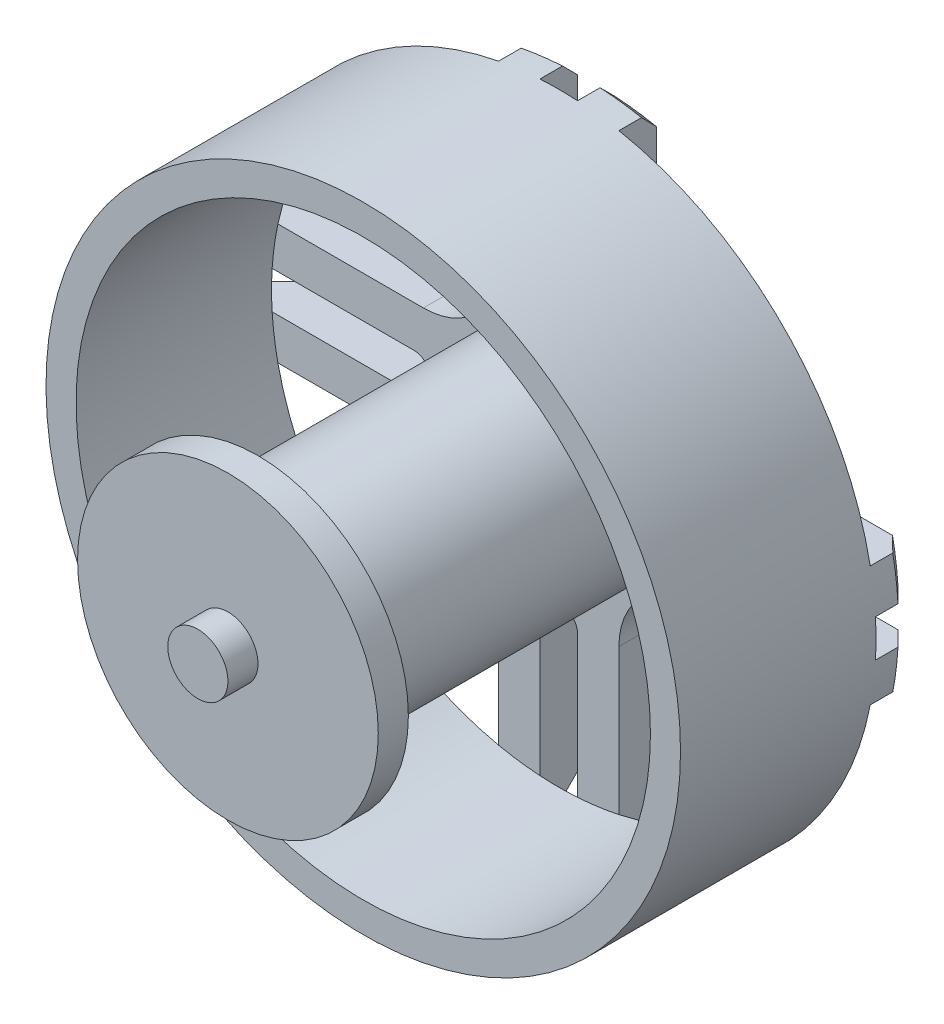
ISO-10303-21;
HEADER;
FILE_DESCRIPTION(('STEP AP214'),'2;1');
FILE_NAME('part.step','',(''),(''),'','','');
FILE_SCHEMA(('AUTOMOTIVE_DESIGN { 1 0 10303 214 1 1 1 1 }'));
ENDSEC;
DATA;
#1=APPLICATION_CONTEXT('core data for automotive mechanical design processes');
#2=APPLICATION_PROTOCOL_DEFINITION('international standard','automotive_design',2000,#1);
#3=PRODUCT_CONTEXT('',#1,'mechanical');
#4=PRODUCT('Part','Part','',(#3));
#5=PRODUCT_RELATED_PRODUCT_CATEGORY('part','',(#4));
#6=PRODUCT_DEFINITION_FORMATION('','',#4);
#7=PRODUCT_DEFINITION_CONTEXT('part definition',#1,'design');
#8=PRODUCT_DEFINITION('design','',#6,#7);
#9=PRODUCT_DEFINITION_SHAPE('','',#8);
#10=(LENGTH_UNIT() NAMED_UNIT(*) SI_UNIT(.MILLI.,.METRE.));
#11=(NAMED_UNIT(*) PLANE_ANGLE_UNIT() SI_UNIT($,.RADIAN.));
#12=(NAMED_UNIT(*) SI_UNIT($,.STERADIAN.) SOLID_ANGLE_UNIT());
#13=UNCERTAINTY_MEASURE_WITH_UNIT(LENGTH_MEASURE(1.E-05),#10,'distance_accuracy_value','');
#14=(GEOMETRIC_REPRESENTATION_CONTEXT(3) GLOBAL_UNCERTAINTY_ASSIGNED_CONTEXT((#13)) GLOBAL_UNIT_ASSIGNED_CONTEXT((#10,
#11,#12)) REPRESENTATION_CONTEXT('',''));
#15=CARTESIAN_POINT('',(0.,0.,0.));
#16=DIRECTION('',(0.,0.,1.));
#17=DIRECTION('',(1.,0.,0.));
#18=AXIS2_PLACEMENT_3D('',#15,#16,#17);
#19=CARTESIAN_POINT('',(0.,0.,2.5));
#20=DIRECTION('',(0.,0.,1.));
#21=DIRECTION('',(1.,0.,0.));
#22=AXIS2_PLACEMENT_3D('',#19,#20,#21);
#23=PLANE('',#22);
#24=CARTESIAN_POINT('',(0.,0.,2.5));
#25=DIRECTION('',(0.,0.,1.));
#26=DIRECTION('',(1.,0.,0.));
#27=AXIS2_PLACEMENT_3D('',#24,#25,#26);
#28=CIRCLE('',#27,7.);
#29=CARTESIAN_POINT('',(7.,0.,2.5));
#30=VERTEX_POINT('',#29);
#31=EDGE_CURVE('E726',#30,#30,#28,.T.);
#32=ORIENTED_EDGE('',*,*,#31,.F.);
#33=EDGE_LOOP('',(#32));
#34=FACE_BOUND('',#33,.T.);
#35=CARTESIAN_POINT('',(0.,0.,2.5));
#36=DIRECTION('',(0.,0.,1.));
#37=DIRECTION('',(1.,0.,0.));
#38=AXIS2_PLACEMENT_3D('',#35,#36,#37);
#39=CIRCLE('',#38,19.1);
#40=CARTESIAN_POINT('',(1.25000000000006,-19.0590529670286,2.5));
#41=VERTEX_POINT('',#40);
#42=CARTESIAN_POINT('',(4.00261599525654,-18.6758952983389,2.5));
#43=VERTEX_POINT('',#42);
#44=EDGE_CURVE('E1105',#41,#43,#39,.T.);
#45=ORIENTED_EDGE('',*,*,#44,.T.);
#46=DIRECTION('',(0.,1.,0.));
#47=VECTOR('',#46,1.);
#48=CARTESIAN_POINT('',(4.00261599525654,-4.00000000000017,2.5));
#49=LINE('',#48,#47);
#50=CARTESIAN_POINT('',(4.00261599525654,-9.00000000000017,2.5));
#51=VERTEX_POINT('',#50);
#52=EDGE_CURVE('E654',#43,#51,#49,.T.);
#53=ORIENTED_EDGE('',*,*,#52,.T.);
#54=CARTESIAN_POINT('',(9.00261599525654,-9.00000000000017,2.5));
#55=DIRECTION('',(0.,0.,1.));
#56=DIRECTION('',(1.,0.,0.));
#57=AXIS2_PLACEMENT_3D('',#54,#55,#56);
#58=CIRCLE('',#57,5.);
#59=CARTESIAN_POINT('',(9.00261599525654,-4.00000000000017,2.5));
#60=VERTEX_POINT('',#59);
#61=EDGE_CURVE('E957',#51,#60,#58,.F.);
#62=ORIENTED_EDGE('',*,*,#61,.T.);
#63=DIRECTION('',(1.,0.,0.));
#64=VECTOR('',#63,1.);
#65=CARTESIAN_POINT('',(20.72,-4.00000000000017,2.5));
#66=LINE('',#65,#64);
#67=CARTESIAN_POINT('',(18.6764557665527,-4.00000000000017,2.5));
#68=VERTEX_POINT('',#67);
#69=EDGE_CURVE('E652',#60,#68,#66,.T.);
#70=ORIENTED_EDGE('',*,*,#69,.T.);
#71=CARTESIAN_POINT('',(19.0590529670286,-1.24999999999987,2.5));
#72=VERTEX_POINT('',#71);
#73=EDGE_CURVE('E742',#68,#72,#39,.T.);
#74=ORIENTED_EDGE('',*,*,#73,.T.);
#75=DIRECTION('',(-1.,0.,0.));
#76=VECTOR('',#75,1.);
#77=CARTESIAN_POINT('',(33.6,-1.24999999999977,2.5));
#78=LINE('',#77,#76);
#79=CARTESIAN_POINT('',(9.60000000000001,-1.24999999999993,2.5));
#80=VERTEX_POINT('',#79);
#81=EDGE_CURVE('E623',#72,#80,#78,.T.);
#82=ORIENTED_EDGE('',*,*,#81,.T.);
#83=CARTESIAN_POINT('',(9.6,-0.249999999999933,2.5));
#84=DIRECTION('',(0.,0.,1.));
#85=DIRECTION('',(1.,0.,0.));
#86=AXIS2_PLACEMENT_3D('',#83,#84,#85);
#87=CIRCLE('',#86,1.);
#88=CARTESIAN_POINT('',(8.6,-0.24999999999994,2.5));
#89=VERTEX_POINT('',#88);
#90=EDGE_CURVE('E907',#80,#89,#87,.F.);
#91=ORIENTED_EDGE('',*,*,#90,.T.);
#92=DIRECTION('',(0.,1.,0.));
#93=VECTOR('',#92,1.);
#94=CARTESIAN_POINT('',(8.60000000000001,-1.24999999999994,2.5));
#95=LINE('',#94,#93);
#96=CARTESIAN_POINT('',(8.6,0.25000000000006,2.5));
#97=VERTEX_POINT('',#96);
#98=EDGE_CURVE('E617',#89,#97,#95,.T.);
#99=ORIENTED_EDGE('',*,*,#98,.T.);
#100=CARTESIAN_POINT('',(9.6,0.250000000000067,2.5));
#101=DIRECTION('',(0.,0.,1.));
#102=DIRECTION('',(1.,0.,0.));
#103=AXIS2_PLACEMENT_3D('',#100,#101,#102);
#104=CIRCLE('',#103,1.);
#105=CARTESIAN_POINT('',(9.6,1.25000000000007,2.5));
#106=VERTEX_POINT('',#105);
#107=EDGE_CURVE('E904',#97,#106,#104,.F.);
#108=ORIENTED_EDGE('',*,*,#107,.T.);
#109=DIRECTION('',(1.,0.,0.));
#110=VECTOR('',#109,1.);
#111=CARTESIAN_POINT('',(33.6,1.25000000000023,2.5));
#112=LINE('',#111,#110);
#113=CARTESIAN_POINT('',(19.0590529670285,1.25000000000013,2.5));
#114=VERTEX_POINT('',#113);
#115=EDGE_CURVE('E1192',#106,#114,#112,.T.);
#116=ORIENTED_EDGE('',*,*,#115,.T.);
#117=CARTESIAN_POINT('',(18.6758952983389,4.00261599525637,2.5));
#118=VERTEX_POINT('',#117);
#119=EDGE_CURVE('E737',#114,#118,#39,.T.);
#120=ORIENTED_EDGE('',*,*,#119,.T.);
#121=DIRECTION('',(-1.,0.,0.));
#122=VECTOR('',#121,1.);
#123=CARTESIAN_POINT('',(4.00261599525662,4.00261599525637,2.5));
#124=LINE('',#123,#122);
#125=CARTESIAN_POINT('',(9.00261599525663,4.00261599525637,2.5));
#126=VERTEX_POINT('',#125);
#127=EDGE_CURVE('E663',#118,#126,#124,.T.);
#128=ORIENTED_EDGE('',*,*,#127,.T.);
#129=CARTESIAN_POINT('',(9.00261599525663,9.00261599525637,2.5));
#130=DIRECTION('',(0.,0.,1.));
#131=DIRECTION('',(1.,0.,0.));
#132=AXIS2_PLACEMENT_3D('',#129,#130,#131);
#133=CIRCLE('',#132,5.);
#134=CARTESIAN_POINT('',(4.00261599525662,9.00261599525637,2.5));
#135=VERTEX_POINT('',#134);
#136=EDGE_CURVE('E960',#126,#135,#133,.F.);
#137=ORIENTED_EDGE('',*,*,#136,.T.);
#138=DIRECTION('',(0.,1.,0.));
#139=VECTOR('',#138,1.);
#140=CARTESIAN_POINT('',(4.00261599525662,20.7199999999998,2.5));
#141=LINE('',#140,#139);
#142=CARTESIAN_POINT('',(4.00261599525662,18.6758952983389,2.5));
#143=VERTEX_POINT('',#142);
#144=EDGE_CURVE('E662',#135,#143,#141,.T.);
#145=ORIENTED_EDGE('',*,*,#144,.T.);
#146=CARTESIAN_POINT('',(1.2499999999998,19.0590529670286,2.5));
#147=VERTEX_POINT('',#146);
#148=EDGE_CURVE('E741',#143,#147,#39,.T.);
#149=ORIENTED_EDGE('',*,*,#148,.T.);
#150=DIRECTION('',(0.,-1.,0.));
#151=VECTOR('',#150,1.);
#152=CARTESIAN_POINT('',(1.24999999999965,33.6,2.5));
#153=LINE('',#152,#151);
#154=CARTESIAN_POINT('',(1.2499999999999,9.60000000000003,2.5));
#155=VERTEX_POINT('',#154);
#156=EDGE_CURVE('E620',#147,#155,#153,.T.);
#157=ORIENTED_EDGE('',*,*,#156,.T.);
#158=CARTESIAN_POINT('',(0.249999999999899,9.60000000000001,2.5));
#159=DIRECTION('',(0.,0.,1.));
#160=DIRECTION('',(1.,0.,0.));
#161=AXIS2_PLACEMENT_3D('',#158,#159,#160);
#162=CIRCLE('',#161,1.);
#163=CARTESIAN_POINT('',(0.24999999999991,8.60000000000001,2.5));
#164=VERTEX_POINT('',#163);
#165=EDGE_CURVE('E11',#155,#164,#162,.F.);
#166=ORIENTED_EDGE('',*,*,#165,.T.);
#167=DIRECTION('',(-1.,0.,0.));
#168=VECTOR('',#167,1.);
#169=CARTESIAN_POINT('',(1.24999999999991,8.60000000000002,2.5));
#170=LINE('',#169,#168);
#171=CARTESIAN_POINT('',(-0.25000000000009,8.6,2.5));
#172=VERTEX_POINT('',#171);
#173=EDGE_CURVE('E626',#164,#172,#170,.T.);
#174=ORIENTED_EDGE('',*,*,#173,.T.);
#175=CARTESIAN_POINT('',(-0.250000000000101,9.6,2.5));
#176=DIRECTION('',(0.,0.,1.));
#177=DIRECTION('',(1.,0.,0.));
#178=AXIS2_PLACEMENT_3D('',#175,#176,#177);
#179=CIRCLE('',#178,1.);
#180=CARTESIAN_POINT('',(-1.2500000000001,9.6,2.5));
#181=VERTEX_POINT('',#180);
#182=EDGE_CURVE('E887',#172,#181,#179,.F.);
#183=ORIENTED_EDGE('',*,*,#182,.T.);
#184=DIRECTION('',(0.,1.,0.));
#185=VECTOR('',#184,1.);
#186=CARTESIAN_POINT('',(-1.25000000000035,33.6,2.5));
#187=LINE('',#186,#185);
#188=CARTESIAN_POINT('',(-1.2500000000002,19.0590529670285,2.5));
#189=VERTEX_POINT('',#188);
#190=EDGE_CURVE('E631',#181,#189,#187,.T.);
#191=ORIENTED_EDGE('',*,*,#190,.T.);
#192=CARTESIAN_POINT('',(-3.99999999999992,18.6764557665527,2.5));
#193=VERTEX_POINT('',#192);
#194=EDGE_CURVE('E1103',#189,#193,#39,.T.);
#195=ORIENTED_EDGE('',*,*,#194,.T.);
#196=DIRECTION('',(0.,-1.,0.));
#197=VECTOR('',#196,1.);
#198=CARTESIAN_POINT('',(-3.99999999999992,20.72,2.5));
#199=LINE('',#198,#197);
#200=CARTESIAN_POINT('',(-3.99999999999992,9.00261599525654,2.5));
#201=VERTEX_POINT('',#200);
#202=EDGE_CURVE('E672',#193,#201,#199,.T.);
#203=ORIENTED_EDGE('',*,*,#202,.T.);
#204=CARTESIAN_POINT('',(-8.99999999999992,9.00261599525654,2.5));
#205=DIRECTION('',(0.,0.,1.));
#206=DIRECTION('',(1.,0.,0.));
#207=AXIS2_PLACEMENT_3D('',#204,#205,#206);
#208=CIRCLE('',#207,5.);
#209=CARTESIAN_POINT('',(-8.99999999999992,4.00261599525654,2.5));
#210=VERTEX_POINT('',#209);
#211=EDGE_CURVE('E964',#201,#210,#208,.F.);
#212=ORIENTED_EDGE('',*,*,#211,.T.);
#213=DIRECTION('',(-1.,0.,0.));
#214=VECTOR('',#213,1.);
#215=CARTESIAN_POINT('',(-20.7173840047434,4.00261599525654,2.5));
#216=LINE('',#215,#214);
#217=CARTESIAN_POINT('',(-18.6758952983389,4.00261599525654,2.5));
#218=VERTEX_POINT('',#217);
#219=EDGE_CURVE('E671',#210,#218,#216,.T.);
#220=ORIENTED_EDGE('',*,*,#219,.T.);
#221=CARTESIAN_POINT('',(-19.0590529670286,1.25,2.5));
#222=VERTEX_POINT('',#221);
#223=EDGE_CURVE('E1089',#218,#222,#39,.T.);
#224=ORIENTED_EDGE('',*,*,#223,.T.);
#225=DIRECTION('',(1.,0.,0.));
#226=VECTOR('',#225,1.);
#227=CARTESIAN_POINT('',(-33.6,1.25,2.5));
#228=LINE('',#227,#226);
#229=CARTESIAN_POINT('',(-9.6,1.25,2.5));
#230=VERTEX_POINT('',#229);
#231=EDGE_CURVE('E645',#222,#230,#228,.T.);
#232=ORIENTED_EDGE('',*,*,#231,.T.);
#233=CARTESIAN_POINT('',(-9.6,0.25,2.5));
#234=DIRECTION('',(0.,0.,1.));
#235=DIRECTION('',(1.,0.,0.));
#236=AXIS2_PLACEMENT_3D('',#233,#234,#235);
#237=CIRCLE('',#236,1.);
#238=CARTESIAN_POINT('',(-8.6,0.25,2.5));
#239=VERTEX_POINT('',#238);
#240=EDGE_CURVE('E894',#230,#239,#237,.F.);
#241=ORIENTED_EDGE('',*,*,#240,.T.);
#242=DIRECTION('',(0.,-1.,0.));
#243=VECTOR('',#242,1.);
#244=CARTESIAN_POINT('',(-8.6,1.25,2.5));
#245=LINE('',#244,#243);
#246=CARTESIAN_POINT('',(-8.6,-0.25,2.5));
#247=VERTEX_POINT('',#246);
#248=EDGE_CURVE('E638',#239,#247,#245,.T.);
#249=ORIENTED_EDGE('',*,*,#248,.T.);
#250=CARTESIAN_POINT('',(-9.6,-0.25,2.5));
#251=DIRECTION('',(0.,0.,1.));
#252=DIRECTION('',(1.,0.,0.));
#253=AXIS2_PLACEMENT_3D('',#250,#251,#252);
#254=CIRCLE('',#253,1.);
#255=CARTESIAN_POINT('',(-9.6,-1.25,2.5));
#256=VERTEX_POINT('',#255);
#257=EDGE_CURVE('E900',#247,#256,#254,.F.);
#258=ORIENTED_EDGE('',*,*,#257,.T.);
#259=DIRECTION('',(-1.,0.,0.));
#260=VECTOR('',#259,1.);
#261=CARTESIAN_POINT('',(-33.6,-1.25,2.5));
#262=LINE('',#261,#260);
#263=CARTESIAN_POINT('',(-19.0590529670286,-1.25,2.5));
#264=VERTEX_POINT('',#263);
#265=EDGE_CURVE('E643',#256,#264,#262,.T.);
#266=ORIENTED_EDGE('',*,*,#265,.T.);
#267=CARTESIAN_POINT('',(-18.6764557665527,-4.,2.5));
#268=VERTEX_POINT('',#267);
#269=EDGE_CURVE('E1100',#264,#268,#39,.T.);
#270=ORIENTED_EDGE('',*,*,#269,.T.);
#271=DIRECTION('',(1.,0.,0.));
#272=VECTOR('',#271,1.);
#273=CARTESIAN_POINT('',(-4.,-4.,2.5));
#274=LINE('',#273,#272);
#275=CARTESIAN_POINT('',(-9.,-4.,2.5));
#276=VERTEX_POINT('',#275);
#277=EDGE_CURVE('E681',#268,#276,#274,.T.);
#278=ORIENTED_EDGE('',*,*,#277,.T.);
#279=CARTESIAN_POINT('',(-9.,-9.,2.5));
#280=DIRECTION('',(0.,0.,1.));
#281=DIRECTION('',(1.,0.,0.));
#282=AXIS2_PLACEMENT_3D('',#279,#280,#281);
#283=CIRCLE('',#282,5.);
#284=CARTESIAN_POINT('',(-4.,-9.,2.5));
#285=VERTEX_POINT('',#284);
#286=EDGE_CURVE('E953',#276,#285,#283,.F.);
#287=ORIENTED_EDGE('',*,*,#286,.T.);
#288=DIRECTION('',(0.,-1.,0.));
#289=VECTOR('',#288,1.);
#290=CARTESIAN_POINT('',(-4.,-4.,2.5));
#291=LINE('',#290,#289);
#292=CARTESIAN_POINT('',(-4.,-18.6764557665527,2.5));
#293=VERTEX_POINT('',#292);
#294=EDGE_CURVE('E398',#285,#293,#291,.T.);
#295=ORIENTED_EDGE('',*,*,#294,.T.);
#296=CARTESIAN_POINT('',(-1.24999999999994,-19.0590529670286,2.5));
#297=VERTEX_POINT('',#296);
#298=EDGE_CURVE('E1102',#293,#297,#39,.T.);
#299=ORIENTED_EDGE('',*,*,#298,.T.);
#300=DIRECTION('',(0.,1.,0.));
#301=VECTOR('',#300,1.);
#302=CARTESIAN_POINT('',(-1.24999999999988,-33.6,2.5));
#303=LINE('',#302,#301);
#304=CARTESIAN_POINT('',(-1.24999999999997,-9.60000000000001,2.5));
#305=VERTEX_POINT('',#304);
#306=EDGE_CURVE('E1176',#297,#305,#303,.T.);
#307=ORIENTED_EDGE('',*,*,#306,.T.);
#308=CARTESIAN_POINT('',(-0.249999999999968,-9.60000000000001,2.5));
#309=DIRECTION('',(0.,0.,1.));
#310=DIRECTION('',(1.,0.,0.));
#311=AXIS2_PLACEMENT_3D('',#308,#309,#310);
#312=CIRCLE('',#311,1.);
#313=CARTESIAN_POINT('',(-0.249999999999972,-8.60000000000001,2.5));
#314=VERTEX_POINT('',#313);
#315=EDGE_CURVE('E910',#305,#314,#312,.F.);
#316=ORIENTED_EDGE('',*,*,#315,.T.);
#317=DIRECTION('',(1.,0.,0.));
#318=VECTOR('',#317,1.);
#319=CARTESIAN_POINT('',(-1.24999999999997,-8.60000000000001,2.5));
#320=LINE('',#319,#318);
#321=CARTESIAN_POINT('',(0.250000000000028,-8.6,2.5));
#322=VERTEX_POINT('',#321);
#323=EDGE_CURVE('E1189',#314,#322,#320,.T.);
#324=ORIENTED_EDGE('',*,*,#323,.T.);
#325=CARTESIAN_POINT('',(0.250000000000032,-9.6,2.5));
#326=DIRECTION('',(0.,0.,1.));
#327=DIRECTION('',(1.,0.,0.));
#328=AXIS2_PLACEMENT_3D('',#325,#326,#327);
#329=CIRCLE('',#328,1.);
#330=CARTESIAN_POINT('',(1.25000000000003,-9.60000000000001,2.5));
#331=VERTEX_POINT('',#330);
#332=EDGE_CURVE('E914',#322,#331,#329,.F.);
#333=ORIENTED_EDGE('',*,*,#332,.T.);
#334=DIRECTION('',(0.,-1.,0.));
#335=VECTOR('',#334,1.);
#336=CARTESIAN_POINT('',(1.25000000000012,-33.6,2.5));
#337=LINE('',#336,#335);
#338=EDGE_CURVE('E1180',#331,#41,#337,.T.);
#339=ORIENTED_EDGE('',*,*,#338,.T.);
#340=EDGE_LOOP('',(#45,#53,#62,#70,#74,#82,#91,#99,#108,#116,#120,#128,#137,#145,#149,#157,#166,
#174,#183,#191,#195,#203,#212,#220,#224,#232,#241,#249,#258,#266,#270,#278,#287,#295,#299,#307,
#316,#324,#333,#339));
#341=FACE_BOUND('',#340,.T.);
#342=ADVANCED_FACE('F35',(#34,#341),#23,.T.);
#343=CARTESIAN_POINT('',(0.,0.,15.5));
#344=DIRECTION('',(0.,0.,-1.));
#345=DIRECTION('',(-1.,0.,0.));
#346=AXIS2_PLACEMENT_3D('',#343,#344,#345);
#347=CYLINDRICAL_SURFACE('',#346,21.1);
#348=DIRECTION('',(0.,0.,-1.));
#349=VECTOR('',#348,1.);
#350=CARTESIAN_POINT('',(20.7173840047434,-4.00000000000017,15.5));
#351=LINE('',#350,#349);
#352=CARTESIAN_POINT('',(20.7173840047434,-4.00000000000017,2.5));
#353=VERTEX_POINT('',#352);
#354=CARTESIAN_POINT('',(20.7173840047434,-4.00000000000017,1.));
#355=VERTEX_POINT('',#354);
#356=EDGE_CURVE('E716',#353,#355,#351,.T.);
#357=ORIENTED_EDGE('',*,*,#356,.T.);
#358=CARTESIAN_POINT('',(0.,0.,1.));
#359=DIRECTION('',(0.,0.,1.));
#360=DIRECTION('',(1.,0.,0.));
#361=AXIS2_PLACEMENT_3D('',#358,#359,#360);
#362=CIRCLE('',#361,21.1);
#363=CARTESIAN_POINT('',(21.0629413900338,-1.24999999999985,1.));
#364=VERTEX_POINT('',#363);
#365=EDGE_CURVE('E465',#355,#364,#362,.T.);
#366=ORIENTED_EDGE('',*,*,#365,.T.);
#367=DIRECTION('',(0.,0.,-1.));
#368=VECTOR('',#367,1.);
#369=CARTESIAN_POINT('',(21.0629413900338,-1.24999999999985,15.5));
#370=LINE('',#369,#368);
#371=CARTESIAN_POINT('',(21.0629413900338,-1.24999999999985,2.5));
#372=VERTEX_POINT('',#371);
#373=EDGE_CURVE('E697',#364,#372,#370,.F.);
#374=ORIENTED_EDGE('',*,*,#373,.T.);
#375=CARTESIAN_POINT('',(0.,0.,2.5));
#376=DIRECTION('',(0.,0.,1.));
#377=DIRECTION('',(1.,0.,0.));
#378=AXIS2_PLACEMENT_3D('',#375,#376,#377);
#379=CIRCLE('',#378,21.1);
#380=CARTESIAN_POINT('',(21.0629413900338,1.25000000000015,2.5));
#381=VERTEX_POINT('',#380);
#382=EDGE_CURVE('E421',#372,#381,#379,.T.);
#383=ORIENTED_EDGE('',*,*,#382,.T.);
#384=DIRECTION('',(0.,0.,-1.));
#385=VECTOR('',#384,1.);
#386=CARTESIAN_POINT('',(21.0629413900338,1.25000000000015,15.5));
#387=LINE('',#386,#385);
#388=CARTESIAN_POINT('',(21.0629413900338,1.25000000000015,1.00000000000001));
#389=VERTEX_POINT('',#388);
#390=EDGE_CURVE('E694',#381,#389,#387,.T.);
#391=ORIENTED_EDGE('',*,*,#390,.T.);
#392=CARTESIAN_POINT('',(0.,0.,1.00000000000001));
#393=DIRECTION('',(0.,0.,1.));
#394=DIRECTION('',(1.,0.,0.));
#395=AXIS2_PLACEMENT_3D('',#392,#393,#394);
#396=CIRCLE('',#395,21.1);
#397=CARTESIAN_POINT('',(20.7168787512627,4.00261599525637,1.00000000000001));
#398=VERTEX_POINT('',#397);
#399=EDGE_CURVE('E462',#389,#398,#396,.T.);
#400=ORIENTED_EDGE('',*,*,#399,.T.);
#401=DIRECTION('',(0.,0.,-1.));
#402=VECTOR('',#401,1.);
#403=CARTESIAN_POINT('',(20.7168787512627,4.00261599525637,15.5));
#404=LINE('',#403,#402);
#405=CARTESIAN_POINT('',(20.7168787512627,4.00261599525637,2.5));
#406=VERTEX_POINT('',#405);
#407=EDGE_CURVE('E709',#398,#406,#404,.F.);
#408=ORIENTED_EDGE('',*,*,#407,.T.);
#409=CARTESIAN_POINT('',(0.,0.,2.5));
#410=DIRECTION('',(0.,0.,1.));
#411=DIRECTION('',(1.,0.,0.));
#412=AXIS2_PLACEMENT_3D('',#409,#410,#411);
#413=CIRCLE('',#412,21.1);
#414=CARTESIAN_POINT('',(4.00261599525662,20.7168787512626,2.5));
#415=VERTEX_POINT('',#414);
#416=EDGE_CURVE('E435',#406,#415,#413,.T.);
#417=ORIENTED_EDGE('',*,*,#416,.T.);
#418=DIRECTION('',(0.,0.,-1.));
#419=VECTOR('',#418,1.);
#420=CARTESIAN_POINT('',(4.00261599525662,20.7168787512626,15.5));
#421=LINE('',#420,#419);
#422=CARTESIAN_POINT('',(4.00261599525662,20.7168787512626,1.));
#423=VERTEX_POINT('',#422);
#424=EDGE_CURVE('E711',#415,#423,#421,.T.);
#425=ORIENTED_EDGE('',*,*,#424,.T.);
#426=CARTESIAN_POINT('',(0.,0.,1.));
#427=DIRECTION('',(0.,0.,1.));
#428=DIRECTION('',(1.,0.,0.));
#429=AXIS2_PLACEMENT_3D('',#426,#427,#428);
#430=CIRCLE('',#429,21.1);
#431=CARTESIAN_POINT('',(1.24999999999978,21.0629413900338,1.));
#432=VERTEX_POINT('',#431);
#433=EDGE_CURVE('E445',#423,#432,#430,.T.);
#434=ORIENTED_EDGE('',*,*,#433,.T.);
#435=DIRECTION('',(0.,0.,-1.));
#436=VECTOR('',#435,1.);
#437=CARTESIAN_POINT('',(1.24999999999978,21.0629413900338,15.5));
#438=LINE('',#437,#436);
#439=CARTESIAN_POINT('',(1.24999999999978,21.0629413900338,2.5));
#440=VERTEX_POINT('',#439);
#441=EDGE_CURVE('E692',#432,#440,#438,.F.);
#442=ORIENTED_EDGE('',*,*,#441,.T.);
#443=CARTESIAN_POINT('',(0.,0.,2.5));
#444=DIRECTION('',(0.,0.,1.));
#445=DIRECTION('',(1.,0.,0.));
#446=AXIS2_PLACEMENT_3D('',#443,#444,#445);
#447=CIRCLE('',#446,21.1);
#448=CARTESIAN_POINT('',(-1.25000000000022,21.0629413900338,2.5));
#449=VERTEX_POINT('',#448);
#450=EDGE_CURVE('E417',#440,#449,#447,.T.);
#451=ORIENTED_EDGE('',*,*,#450,.T.);
#452=DIRECTION('',(0.,0.,-1.));
#453=VECTOR('',#452,1.);
#454=CARTESIAN_POINT('',(-1.25000000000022,21.0629413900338,15.5));
#455=LINE('',#454,#453);
#456=CARTESIAN_POINT('',(-1.25000000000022,21.0629413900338,1.00000000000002));
#457=VERTEX_POINT('',#456);
#458=EDGE_CURVE('E688',#449,#457,#455,.T.);
#459=ORIENTED_EDGE('',*,*,#458,.T.);
#460=CARTESIAN_POINT('',(0.,0.,1.00000000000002));
#461=DIRECTION('',(0.,0.,1.));
#462=DIRECTION('',(1.,0.,0.));
#463=AXIS2_PLACEMENT_3D('',#460,#461,#462);
#464=CIRCLE('',#463,21.1);
#465=CARTESIAN_POINT('',(-3.99999999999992,20.7173840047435,1.00000000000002));
#466=VERTEX_POINT('',#465);
#467=EDGE_CURVE('E448',#457,#466,#464,.T.);
#468=ORIENTED_EDGE('',*,*,#467,.T.);
#469=DIRECTION('',(0.,0.,-1.));
#470=VECTOR('',#469,1.);
#471=CARTESIAN_POINT('',(-3.99999999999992,20.7173840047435,15.5));
#472=LINE('',#471,#470);
#473=CARTESIAN_POINT('',(-3.99999999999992,20.7173840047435,2.5));
#474=VERTEX_POINT('',#473);
#475=EDGE_CURVE('E707',#466,#474,#472,.F.);
#476=ORIENTED_EDGE('',*,*,#475,.T.);
#477=CARTESIAN_POINT('',(0.,0.,2.5));
#478=DIRECTION('',(0.,0.,1.));
#479=DIRECTION('',(1.,0.,0.));
#480=AXIS2_PLACEMENT_3D('',#477,#478,#479);
#481=CIRCLE('',#480,21.1);
#482=CARTESIAN_POINT('',(-20.7168787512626,4.00261599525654,2.5));
#483=VERTEX_POINT('',#482);
#484=EDGE_CURVE('E432',#474,#483,#481,.T.);
#485=ORIENTED_EDGE('',*,*,#484,.T.);
#486=DIRECTION('',(0.,0.,-1.));
#487=VECTOR('',#486,1.);
#488=CARTESIAN_POINT('',(-20.7168787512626,4.00261599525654,15.5));
#489=LINE('',#488,#487);
#490=CARTESIAN_POINT('',(-20.7168787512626,4.00261599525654,1.00000000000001));
#491=VERTEX_POINT('',#490);
#492=EDGE_CURVE('E704',#483,#491,#489,.T.);
#493=ORIENTED_EDGE('',*,*,#492,.T.);
#494=CARTESIAN_POINT('',(0.,0.,1.00000000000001));
#495=DIRECTION('',(0.,0.,1.));
#496=DIRECTION('',(1.,0.,0.));
#497=AXIS2_PLACEMENT_3D('',#494,#495,#496);
#498=CIRCLE('',#497,21.1);
#499=CARTESIAN_POINT('',(-21.0629413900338,1.25,1.00000000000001));
#500=VERTEX_POINT('',#499);
#501=EDGE_CURVE('E452',#491,#500,#498,.T.);
#502=ORIENTED_EDGE('',*,*,#501,.T.);
#503=DIRECTION('',(0.,0.,-1.));
#504=VECTOR('',#503,1.);
#505=CARTESIAN_POINT('',(-21.0629413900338,1.25,15.5));
#506=LINE('',#505,#504);
#507=CARTESIAN_POINT('',(-21.0629413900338,1.25,2.5));
#508=VERTEX_POINT('',#507);
#509=EDGE_CURVE('E721',#500,#508,#506,.F.);
#510=ORIENTED_EDGE('',*,*,#509,.T.);
#511=CARTESIAN_POINT('',(0.,0.,2.5));
#512=DIRECTION('',(0.,0.,1.));
#513=DIRECTION('',(1.,0.,0.));
#514=AXIS2_PLACEMENT_3D('',#511,#512,#513);
#515=CIRCLE('',#514,21.1);
#516=CARTESIAN_POINT('',(-21.0629413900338,-1.25,2.5));
#517=VERTEX_POINT('',#516);
#518=EDGE_CURVE('E441',#508,#517,#515,.T.);
#519=ORIENTED_EDGE('',*,*,#518,.T.);
#520=DIRECTION('',(0.,0.,-1.));
#521=VECTOR('',#520,1.);
#522=CARTESIAN_POINT('',(-21.0629413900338,-1.25,15.5));
#523=LINE('',#522,#521);
#524=CARTESIAN_POINT('',(-21.0629413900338,-1.25,1.00000000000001));
#525=VERTEX_POINT('',#524);
#526=EDGE_CURVE('E718',#517,#525,#523,.T.);
#527=ORIENTED_EDGE('',*,*,#526,.T.);
#528=CARTESIAN_POINT('',(0.,0.,1.00000000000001));
#529=DIRECTION('',(0.,0.,1.));
#530=DIRECTION('',(1.,0.,0.));
#531=AXIS2_PLACEMENT_3D('',#528,#529,#530);
#532=CIRCLE('',#531,21.1);
#533=CARTESIAN_POINT('',(-20.7173840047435,-4.,1.00000000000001));
#534=VERTEX_POINT('',#533);
#535=EDGE_CURVE('E455',#525,#534,#532,.T.);
#536=ORIENTED_EDGE('',*,*,#535,.T.);
#537=DIRECTION('',(0.,0.,-1.));
#538=VECTOR('',#537,1.);
#539=CARTESIAN_POINT('',(-20.7173840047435,-4.,2.5));
#540=LINE('',#539,#538);
#541=CARTESIAN_POINT('',(-20.7173840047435,-4.,2.5));
#542=VERTEX_POINT('',#541);
#543=EDGE_CURVE('E409',#542,#534,#540,.T.);
#544=ORIENTED_EDGE('',*,*,#543,.F.);
#545=CARTESIAN_POINT('',(0.,0.,2.5));
#546=DIRECTION('',(0.,0.,1.));
#547=DIRECTION('',(1.,0.,0.));
#548=AXIS2_PLACEMENT_3D('',#545,#546,#547);
#549=CIRCLE('',#548,21.1);
#550=CARTESIAN_POINT('',(-4.00000000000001,-20.7173840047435,2.5));
#551=VERTEX_POINT('',#550);
#552=EDGE_CURVE('E391',#542,#551,#549,.T.);
#553=ORIENTED_EDGE('',*,*,#552,.T.);
#554=DIRECTION('',(0.,0.,-1.));
#555=VECTOR('',#554,1.);
#556=CARTESIAN_POINT('',(-4.00000000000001,-20.7173840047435,2.5));
#557=LINE('',#556,#555);
#558=CARTESIAN_POINT('',(-4.00000000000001,-20.7173840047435,1.00000000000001));
#559=VERTEX_POINT('',#558);
#560=EDGE_CURVE('E402',#551,#559,#557,.T.);
#561=ORIENTED_EDGE('',*,*,#560,.T.);
#562=CARTESIAN_POINT('',(0.,0.,1.00000000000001));
#563=DIRECTION('',(0.,0.,1.));
#564=DIRECTION('',(1.,0.,0.));
#565=AXIS2_PLACEMENT_3D('',#562,#563,#564);
#566=CIRCLE('',#565,21.1);
#567=CARTESIAN_POINT('',(-1.24999999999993,-21.0629413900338,1.00000000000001));
#568=VERTEX_POINT('',#567);
#569=EDGE_CURVE('E457',#559,#568,#566,.T.);
#570=ORIENTED_EDGE('',*,*,#569,.T.);
#571=DIRECTION('',(0.,0.,-1.));
#572=VECTOR('',#571,1.);
#573=CARTESIAN_POINT('',(-1.24999999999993,-21.0629413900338,15.5));
#574=LINE('',#573,#572);
#575=CARTESIAN_POINT('',(-1.24999999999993,-21.0629413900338,2.5));
#576=VERTEX_POINT('',#575);
#577=EDGE_CURVE('E702',#568,#576,#574,.F.);
#578=ORIENTED_EDGE('',*,*,#577,.T.);
#579=CARTESIAN_POINT('',(0.,0.,2.5));
#580=DIRECTION('',(0.,0.,1.));
#581=DIRECTION('',(1.,0.,0.));
#582=AXIS2_PLACEMENT_3D('',#579,#580,#581);
#583=CIRCLE('',#582,21.1);
#584=CARTESIAN_POINT('',(1.25000000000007,-21.0629413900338,2.5));
#585=VERTEX_POINT('',#584);
#586=EDGE_CURVE('E429',#576,#585,#583,.T.);
#587=ORIENTED_EDGE('',*,*,#586,.T.);
#588=DIRECTION('',(0.,0.,-1.));
#589=VECTOR('',#588,1.);
#590=CARTESIAN_POINT('',(1.25000000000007,-21.0629413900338,15.5));
#591=LINE('',#590,#589);
#592=CARTESIAN_POINT('',(1.25000000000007,-21.0629413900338,1.00000000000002));
#593=VERTEX_POINT('',#592);
#594=EDGE_CURVE('E699',#585,#593,#591,.T.);
#595=ORIENTED_EDGE('',*,*,#594,.T.);
#596=CARTESIAN_POINT('',(0.,0.,1.00000000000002));
#597=DIRECTION('',(0.,0.,1.));
#598=DIRECTION('',(1.,0.,0.));
#599=AXIS2_PLACEMENT_3D('',#596,#597,#598);
#600=CIRCLE('',#599,21.1);
#601=CARTESIAN_POINT('',(4.00261599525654,-20.7168787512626,1.00000000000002));
#602=VERTEX_POINT('',#601);
#603=EDGE_CURVE('E459',#593,#602,#600,.T.);
#604=ORIENTED_EDGE('',*,*,#603,.T.);
#605=DIRECTION('',(0.,0.,-1.));
#606=VECTOR('',#605,1.);
#607=CARTESIAN_POINT('',(4.00261599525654,-20.7168787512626,15.5));
#608=LINE('',#607,#606);
#609=CARTESIAN_POINT('',(4.00261599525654,-20.7168787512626,2.5));
#610=VERTEX_POINT('',#609);
#611=EDGE_CURVE('E714',#602,#610,#608,.F.);
#612=ORIENTED_EDGE('',*,*,#611,.T.);
#613=CARTESIAN_POINT('',(0.,0.,2.5));
#614=DIRECTION('',(0.,0.,1.));
#615=DIRECTION('',(1.,0.,0.));
#616=AXIS2_PLACEMENT_3D('',#613,#614,#615);
#617=CIRCLE('',#616,21.1);
#618=EDGE_CURVE('E438',#610,#353,#617,.T.);
#619=ORIENTED_EDGE('',*,*,#618,.T.);
#620=EDGE_LOOP('',(#357,#366,#374,#383,#391,#400,#408,#417,#425,#434,#442,#451,#459,#468,#476,
#485,#493,#502,#510,#519,#527,#536,#544,#553,#561,#570,#578,#587,#595,#604,#612,#619));
#621=FACE_BOUND('',#620,.T.);
#622=CARTESIAN_POINT('',(0.,0.,15.5));
#623=DIRECTION('',(0.,0.,1.));
#624=DIRECTION('',(1.,0.,0.));
#625=AXIS2_PLACEMENT_3D('',#622,#623,#624);
#626=CIRCLE('',#625,21.1);
#627=CARTESIAN_POINT('',(21.1,0.,15.5));
#628=VERTEX_POINT('',#627);
#629=EDGE_CURVE('E740',#628,#628,#626,.T.);
#630=ORIENTED_EDGE('',*,*,#629,.F.);
#631=EDGE_LOOP('',(#630));
#632=FACE_BOUND('',#631,.T.);
#633=ADVANCED_FACE('F413',(#621,#632),#347,.T.);
#634=CARTESIAN_POINT('',(0.,0.,15.5));
#635=DIRECTION('',(0.,0.,1.));
#636=DIRECTION('',(1.,0.,0.));
#637=AXIS2_PLACEMENT_3D('',#634,#635,#636);
#638=PLANE('',#637);
#639=CARTESIAN_POINT('',(0.,0.,15.5));
#640=DIRECTION('',(0.,0.,1.));
#641=DIRECTION('',(1.,0.,0.));
#642=AXIS2_PLACEMENT_3D('',#639,#640,#641);
#643=CIRCLE('',#642,19.1);
#644=CARTESIAN_POINT('',(19.1,0.,15.5));
#645=VERTEX_POINT('',#644);
#646=EDGE_CURVE('E734',#645,#645,#643,.T.);
#647=ORIENTED_EDGE('',*,*,#646,.F.);
#648=EDGE_LOOP('',(#647));
#649=FACE_BOUND('',#648,.T.);
#650=ORIENTED_EDGE('',*,*,#629,.T.);
#651=EDGE_LOOP('',(#650));
#652=FACE_BOUND('',#651,.T.);
#653=ADVANCED_FACE('F567',(#649,#652),#638,.T.);
#654=CARTESIAN_POINT('',(0.,0.,0.));
#655=DIRECTION('',(0.,0.,1.));
#656=DIRECTION('',(1.,0.,0.));
#657=AXIS2_PLACEMENT_3D('',#654,#655,#656);
#658=PLANE('',#657);
#659=CARTESIAN_POINT('',(0.,6.,0.));
#660=DIRECTION('',(0.,0.,-1.));
#661=DIRECTION('',(-1.,0.,0.));
#662=AXIS2_PLACEMENT_3D('',#659,#660,#661);
#663=CIRCLE('',#662,1.5);
#664=CARTESIAN_POINT('',(-1.5,6.,0.));
#665=VERTEX_POINT('',#664);
#666=EDGE_CURVE('E589',#665,#665,#663,.T.);
#667=ORIENTED_EDGE('',*,*,#666,.F.);
#668=EDGE_LOOP('',(#667));
#669=FACE_BOUND('',#668,.T.);
#670=CARTESIAN_POINT('',(-6.00000000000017,1.69795468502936E-13,0.));
#671=DIRECTION('',(0.,0.,-1.));
#672=DIRECTION('',(-1.,0.,0.));
#673=AXIS2_PLACEMENT_3D('',#670,#671,#672);
#674=CIRCLE('',#673,1.50000000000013);
#675=CARTESIAN_POINT('',(-7.5000000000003,1.69795468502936E-13,0.));
#676=VERTEX_POINT('',#675);
#677=EDGE_CURVE('E593',#676,#676,#674,.T.);
#678=ORIENTED_EDGE('',*,*,#677,.F.);
#679=EDGE_LOOP('',(#678));
#680=FACE_BOUND('',#679,.T.);
#681=CARTESIAN_POINT('',(-3.39590937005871E-13,-6.,0.));
#682=DIRECTION('',(0.,0.,-1.));
#683=DIRECTION('',(-1.,0.,0.));
#684=AXIS2_PLACEMENT_3D('',#681,#682,#683);
#685=CIRCLE('',#684,1.50000000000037);
#686=CARTESIAN_POINT('',(-1.5000000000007,-6.,0.));
#687=VERTEX_POINT('',#686);
#688=EDGE_CURVE('E597',#687,#687,#685,.T.);
#689=ORIENTED_EDGE('',*,*,#688,.F.);
#690=EDGE_LOOP('',(#689));
#691=FACE_BOUND('',#690,.T.);
#692=CARTESIAN_POINT('',(5.99999999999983,-1.70530256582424E-13,0.));
#693=DIRECTION('',(0.,0.,-1.));
#694=DIRECTION('',(-1.,0.,0.));
#695=AXIS2_PLACEMENT_3D('',#692,#693,#694);
#696=CIRCLE('',#695,1.50000000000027);
#697=CARTESIAN_POINT('',(4.49999999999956,-1.70530256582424E-13,0.));
#698=VERTEX_POINT('',#697);
#699=EDGE_CURVE('E601',#698,#698,#696,.T.);
#700=ORIENTED_EDGE('',*,*,#699,.F.);
#701=EDGE_LOOP('',(#700));
#702=FACE_BOUND('',#701,.T.);
#703=CARTESIAN_POINT('',(0.,0.,0.));
#704=DIRECTION('',(0.,0.,-1.));
#705=DIRECTION('',(-1.,0.,0.));
#706=AXIS2_PLACEMENT_3D('',#703,#704,#705);
#707=CIRCLE('',#706,2.);
#708=CARTESIAN_POINT('',(-2.,0.,0.));
#709=VERTEX_POINT('',#708);
#710=EDGE_CURVE('E444',#709,#709,#707,.T.);
#711=ORIENTED_EDGE('',*,*,#710,.F.);
#712=EDGE_LOOP('',(#711));
#713=FACE_BOUND('',#712,.T.);
#714=DIRECTION('',(0.,1.,0.));
#715=VECTOR('',#714,1.);
#716=CARTESIAN_POINT('',(8.60000000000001,-1.24999999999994,0.));
#717=LINE('',#716,#715);
#718=CARTESIAN_POINT('',(8.6,-0.24999999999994,0.));
#719=VERTEX_POINT('',#718);
#720=CARTESIAN_POINT('',(8.6,0.25000000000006,0.));
#721=VERTEX_POINT('',#720);
#722=EDGE_CURVE('E606',#719,#721,#717,.T.);
#723=ORIENTED_EDGE('',*,*,#722,.F.);
#724=CARTESIAN_POINT('',(9.6,-0.249999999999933,0.));
#725=DIRECTION('',(0.,0.,1.));
#726=DIRECTION('',(1.,0.,0.));
#727=AXIS2_PLACEMENT_3D('',#724,#725,#726);
#728=CIRCLE('',#727,1.);
#729=CARTESIAN_POINT('',(9.60000000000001,-1.24999999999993,0.));
#730=VERTEX_POINT('',#729);
#731=EDGE_CURVE('E607',#719,#730,#728,.T.);
#732=ORIENTED_EDGE('',*,*,#731,.T.);
#733=DIRECTION('',(1.,0.,0.));
#734=VECTOR('',#733,1.);
#735=CARTESIAN_POINT('',(0.,-1.25,0.));
#736=LINE('',#735,#734);
#737=CARTESIAN_POINT('',(20.0610941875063,-1.24999999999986,0.));
#738=VERTEX_POINT('',#737);
#739=EDGE_CURVE('E749',#730,#738,#736,.T.);
#740=ORIENTED_EDGE('',*,*,#739,.T.);
#741=CARTESIAN_POINT('',(0.,0.,0.));
#742=DIRECTION('',(0.,0.,1.));
#743=DIRECTION('',(1.,0.,0.));
#744=AXIS2_PLACEMENT_3D('',#741,#742,#743);
#745=CIRCLE('',#744,20.1);
#746=CARTESIAN_POINT('',(19.6979694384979,-4.00000000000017,0.));
#747=VERTEX_POINT('',#746);
#748=EDGE_CURVE('E775',#738,#747,#745,.F.);
#749=ORIENTED_EDGE('',*,*,#748,.T.);
#750=DIRECTION('',(1.,0.,0.));
#751=VECTOR('',#750,1.);
#752=CARTESIAN_POINT('',(20.72,-4.00000000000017,0.));
#753=LINE('',#752,#751);
#754=CARTESIAN_POINT('',(9.00261599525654,-4.00000000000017,0.));
#755=VERTEX_POINT('',#754);
#756=EDGE_CURVE('E658',#755,#747,#753,.T.);
#757=ORIENTED_EDGE('',*,*,#756,.F.);
#758=CARTESIAN_POINT('',(9.00261599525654,-9.00000000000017,0.));
#759=DIRECTION('',(0.,0.,1.));
#760=DIRECTION('',(1.,0.,0.));
#761=AXIS2_PLACEMENT_3D('',#758,#759,#760);
#762=CIRCLE('',#761,5.);
#763=CARTESIAN_POINT('',(4.00261599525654,-9.00000000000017,0.));
#764=VERTEX_POINT('',#763);
#765=EDGE_CURVE('E764',#755,#764,#762,.T.);
#766=ORIENTED_EDGE('',*,*,#765,.T.);
#767=DIRECTION('',(0.,-1.,0.));
#768=VECTOR('',#767,1.);
#769=CARTESIAN_POINT('',(4.00261599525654,0.,0.));
#770=LINE('',#769,#768);
#771=CARTESIAN_POINT('',(4.00261599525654,-19.6974380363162,0.));
#772=VERTEX_POINT('',#771);
#773=EDGE_CURVE('E423',#764,#772,#770,.T.);
#774=ORIENTED_EDGE('',*,*,#773,.T.);
#775=CARTESIAN_POINT('',(0.,0.,0.));
#776=DIRECTION('',(0.,0.,1.));
#777=DIRECTION('',(1.,0.,0.));
#778=AXIS2_PLACEMENT_3D('',#775,#776,#777);
#779=CIRCLE('',#778,20.1);
#780=CARTESIAN_POINT('',(1.25000000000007,-20.0610941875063,0.));
#781=VERTEX_POINT('',#780);
#782=EDGE_CURVE('E761',#772,#781,#779,.F.);
#783=ORIENTED_EDGE('',*,*,#782,.T.);
#784=DIRECTION('',(0.,-1.,0.));
#785=VECTOR('',#784,1.);
#786=CARTESIAN_POINT('',(1.25000000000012,-33.6,0.));
#787=LINE('',#786,#785);
#788=CARTESIAN_POINT('',(1.25000000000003,-9.60000000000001,0.));
#789=VERTEX_POINT('',#788);
#790=EDGE_CURVE('E1186',#789,#781,#787,.T.);
#791=ORIENTED_EDGE('',*,*,#790,.F.);
#792=CARTESIAN_POINT('',(0.250000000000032,-9.6,0.));
#793=DIRECTION('',(0.,0.,1.));
#794=DIRECTION('',(1.,0.,0.));
#795=AXIS2_PLACEMENT_3D('',#792,#793,#794);
#796=CIRCLE('',#795,1.);
#797=CARTESIAN_POINT('',(0.250000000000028,-8.6,0.));
#798=VERTEX_POINT('',#797);
#799=EDGE_CURVE('E916',#789,#798,#796,.T.);
#800=ORIENTED_EDGE('',*,*,#799,.T.);
#801=DIRECTION('',(1.,0.,0.));
#802=VECTOR('',#801,1.);
#803=CARTESIAN_POINT('',(-1.24999999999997,-8.60000000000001,0.));
#804=LINE('',#803,#802);
#805=CARTESIAN_POINT('',(-0.249999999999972,-8.60000000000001,0.));
#806=VERTEX_POINT('',#805);
#807=EDGE_CURVE('E1184',#806,#798,#804,.T.);
#808=ORIENTED_EDGE('',*,*,#807,.F.);
#809=CARTESIAN_POINT('',(-0.249999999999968,-9.60000000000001,0.));
#810=DIRECTION('',(0.,0.,1.));
#811=DIRECTION('',(1.,0.,0.));
#812=AXIS2_PLACEMENT_3D('',#809,#810,#811);
#813=CIRCLE('',#812,1.);
#814=CARTESIAN_POINT('',(-1.24999999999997,-9.60000000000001,0.));
#815=VERTEX_POINT('',#814);
#816=EDGE_CURVE('E912',#806,#815,#813,.T.);
#817=ORIENTED_EDGE('',*,*,#816,.T.);
#818=DIRECTION('',(0.,-1.,0.));
#819=VECTOR('',#818,1.);
#820=CARTESIAN_POINT('',(-1.25,0.,0.));
#821=LINE('',#820,#819);
#822=CARTESIAN_POINT('',(-1.24999999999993,-20.0610941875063,0.));
#823=VERTEX_POINT('',#822);
#824=EDGE_CURVE('E751',#815,#823,#821,.T.);
#825=ORIENTED_EDGE('',*,*,#824,.T.);
#826=CARTESIAN_POINT('',(0.,0.,0.));
#827=DIRECTION('',(0.,0.,1.));
#828=DIRECTION('',(1.,0.,0.));
#829=AXIS2_PLACEMENT_3D('',#826,#827,#828);
#830=CIRCLE('',#829,20.1);
#831=CARTESIAN_POINT('',(-4.00000000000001,-19.697969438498,0.));
#832=VERTEX_POINT('',#831);
#833=EDGE_CURVE('E772',#823,#832,#830,.F.);
#834=ORIENTED_EDGE('',*,*,#833,.T.);
#835=DIRECTION('',(0.,-1.,0.));
#836=VECTOR('',#835,1.);
#837=CARTESIAN_POINT('',(-4.,-4.,0.));
#838=LINE('',#837,#836);
#839=CARTESIAN_POINT('',(-4.,-9.,0.));
#840=VERTEX_POINT('',#839);
#841=EDGE_CURVE('E686',#840,#832,#838,.T.);
#842=ORIENTED_EDGE('',*,*,#841,.F.);
#843=CARTESIAN_POINT('',(-9.,-9.,0.));
#844=DIRECTION('',(0.,0.,1.));
#845=DIRECTION('',(1.,0.,0.));
#846=AXIS2_PLACEMENT_3D('',#843,#844,#845);
#847=CIRCLE('',#846,5.);
#848=CARTESIAN_POINT('',(-9.,-4.,0.));
#849=VERTEX_POINT('',#848);
#850=EDGE_CURVE('E955',#840,#849,#847,.T.);
#851=ORIENTED_EDGE('',*,*,#850,.T.);
#852=DIRECTION('',(1.,0.,0.));
#853=VECTOR('',#852,1.);
#854=CARTESIAN_POINT('',(-4.,-4.,0.));
#855=LINE('',#854,#853);
#856=CARTESIAN_POINT('',(-19.697969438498,-4.,0.));
#857=VERTEX_POINT('',#856);
#858=EDGE_CURVE('E683',#857,#849,#855,.T.);
#859=ORIENTED_EDGE('',*,*,#858,.F.);
#860=CARTESIAN_POINT('',(0.,0.,0.));
#861=DIRECTION('',(0.,0.,1.));
#862=DIRECTION('',(1.,0.,0.));
#863=AXIS2_PLACEMENT_3D('',#860,#861,#862);
#864=CIRCLE('',#863,20.1);
#865=CARTESIAN_POINT('',(-20.0610941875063,-1.25,0.));
#866=VERTEX_POINT('',#865);
#867=EDGE_CURVE('E778',#857,#866,#864,.F.);
#868=ORIENTED_EDGE('',*,*,#867,.T.);
#869=DIRECTION('',(-1.,0.,0.));
#870=VECTOR('',#869,1.);
#871=CARTESIAN_POINT('',(-33.6,-1.25,0.));
#872=LINE('',#871,#870);
#873=CARTESIAN_POINT('',(-9.6,-1.25,0.));
#874=VERTEX_POINT('',#873);
#875=EDGE_CURVE('E642',#874,#866,#872,.T.);
#876=ORIENTED_EDGE('',*,*,#875,.F.);
#877=CARTESIAN_POINT('',(-9.6,-0.25,0.));
#878=DIRECTION('',(0.,0.,1.));
#879=DIRECTION('',(1.,0.,0.));
#880=AXIS2_PLACEMENT_3D('',#877,#878,#879);
#881=CIRCLE('',#880,1.);
#882=CARTESIAN_POINT('',(-8.6,-0.25,0.));
#883=VERTEX_POINT('',#882);
#884=EDGE_CURVE('E902',#874,#883,#881,.T.);
#885=ORIENTED_EDGE('',*,*,#884,.T.);
#886=DIRECTION('',(0.,-1.,0.));
#887=VECTOR('',#886,1.);
#888=CARTESIAN_POINT('',(-8.6,1.25,0.));
#889=LINE('',#888,#887);
#890=CARTESIAN_POINT('',(-8.6,0.25,0.));
#891=VERTEX_POINT('',#890);
#892=EDGE_CURVE('E649',#891,#883,#889,.T.);
#893=ORIENTED_EDGE('',*,*,#892,.F.);
#894=CARTESIAN_POINT('',(-9.6,0.25,0.));
#895=DIRECTION('',(0.,0.,1.));
#896=DIRECTION('',(1.,0.,0.));
#897=AXIS2_PLACEMENT_3D('',#894,#895,#896);
#898=CIRCLE('',#897,1.);
#899=CARTESIAN_POINT('',(-9.6,1.25,0.));
#900=VERTEX_POINT('',#899);
#901=EDGE_CURVE('E898',#891,#900,#898,.T.);
#902=ORIENTED_EDGE('',*,*,#901,.T.);
#903=DIRECTION('',(-1.,0.,0.));
#904=VECTOR('',#903,1.);
#905=CARTESIAN_POINT('',(0.,1.25,0.));
#906=LINE('',#905,#904);
#907=CARTESIAN_POINT('',(-20.0610941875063,1.25,0.));
#908=VERTEX_POINT('',#907);
#909=EDGE_CURVE('E418',#900,#908,#906,.T.);
#910=ORIENTED_EDGE('',*,*,#909,.T.);
#911=CARTESIAN_POINT('',(0.,0.,0.));
#912=DIRECTION('',(0.,0.,1.));
#913=DIRECTION('',(1.,0.,0.));
#914=AXIS2_PLACEMENT_3D('',#911,#912,#913);
#915=CIRCLE('',#914,20.1);
#916=CARTESIAN_POINT('',(-19.6974380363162,4.00261599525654,0.));
#917=VERTEX_POINT('',#916);
#918=EDGE_CURVE('E995',#908,#917,#915,.F.);
#919=ORIENTED_EDGE('',*,*,#918,.T.);
#920=DIRECTION('',(-1.,0.,0.));
#921=VECTOR('',#920,1.);
#922=CARTESIAN_POINT('',(-20.7173840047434,4.00261599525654,0.));
#923=LINE('',#922,#921);
#924=CARTESIAN_POINT('',(-8.99999999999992,4.00261599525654,0.));
#925=VERTEX_POINT('',#924);
#926=EDGE_CURVE('E676',#925,#917,#923,.T.);
#927=ORIENTED_EDGE('',*,*,#926,.F.);
#928=CARTESIAN_POINT('',(-8.99999999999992,9.00261599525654,0.));
#929=DIRECTION('',(0.,0.,1.));
#930=DIRECTION('',(1.,0.,0.));
#931=AXIS2_PLACEMENT_3D('',#928,#929,#930);
#932=CIRCLE('',#931,5.);
#933=CARTESIAN_POINT('',(-3.99999999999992,9.00261599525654,0.));
#934=VERTEX_POINT('',#933);
#935=EDGE_CURVE('E966',#925,#934,#932,.T.);
#936=ORIENTED_EDGE('',*,*,#935,.T.);
#937=DIRECTION('',(0.,1.,0.));
#938=VECTOR('',#937,1.);
#939=CARTESIAN_POINT('',(-3.99999999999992,0.,0.));
#940=LINE('',#939,#938);
#941=CARTESIAN_POINT('',(-3.99999999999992,19.697969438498,0.));
#942=VERTEX_POINT('',#941);
#943=EDGE_CURVE('E753',#934,#942,#940,.T.);
#944=ORIENTED_EDGE('',*,*,#943,.T.);
#945=CARTESIAN_POINT('',(0.,0.,0.));
#946=DIRECTION('',(0.,0.,1.));
#947=DIRECTION('',(1.,0.,0.));
#948=AXIS2_PLACEMENT_3D('',#945,#946,#947);
#949=CIRCLE('',#948,20.1);
#950=CARTESIAN_POINT('',(-1.25000000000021,20.0610941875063,0.));
#951=VERTEX_POINT('',#950);
#952=EDGE_CURVE('E1000',#942,#951,#949,.F.);
#953=ORIENTED_EDGE('',*,*,#952,.T.);
#954=DIRECTION('',(0.,1.,0.));
#955=VECTOR('',#954,1.);
#956=CARTESIAN_POINT('',(-1.25000000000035,33.6,0.));
#957=LINE('',#956,#955);
#958=CARTESIAN_POINT('',(-1.2500000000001,9.6,0.));
#959=VERTEX_POINT('',#958);
#960=EDGE_CURVE('E630',#959,#951,#957,.T.);
#961=ORIENTED_EDGE('',*,*,#960,.F.);
#962=CARTESIAN_POINT('',(-0.250000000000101,9.6,0.));
#963=DIRECTION('',(0.,0.,1.));
#964=DIRECTION('',(1.,0.,0.));
#965=AXIS2_PLACEMENT_3D('',#962,#963,#964);
#966=CIRCLE('',#965,1.);
#967=CARTESIAN_POINT('',(-0.25000000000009,8.6,0.));
#968=VERTEX_POINT('',#967);
#969=EDGE_CURVE('E892',#959,#968,#966,.T.);
#970=ORIENTED_EDGE('',*,*,#969,.T.);
#971=DIRECTION('',(-1.,0.,0.));
#972=VECTOR('',#971,1.);
#973=CARTESIAN_POINT('',(1.24999999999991,8.60000000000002,0.));
#974=LINE('',#973,#972);
#975=CARTESIAN_POINT('',(0.24999999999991,8.60000000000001,0.));
#976=VERTEX_POINT('',#975);
#977=EDGE_CURVE('E633',#976,#968,#974,.T.);
#978=ORIENTED_EDGE('',*,*,#977,.F.);
#979=CARTESIAN_POINT('',(0.249999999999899,9.60000000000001,0.));
#980=DIRECTION('',(0.,0.,1.));
#981=DIRECTION('',(1.,0.,0.));
#982=AXIS2_PLACEMENT_3D('',#979,#980,#981);
#983=CIRCLE('',#982,1.);
#984=CARTESIAN_POINT('',(1.2499999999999,9.60000000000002,0.));
#985=VERTEX_POINT('',#984);
#986=EDGE_CURVE('E43',#976,#985,#983,.T.);
#987=ORIENTED_EDGE('',*,*,#986,.T.);
#988=DIRECTION('',(0.,1.,0.));
#989=VECTOR('',#988,1.);
#990=CARTESIAN_POINT('',(1.25,0.,0.));
#991=LINE('',#990,#989);
#992=CARTESIAN_POINT('',(1.24999999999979,20.0610941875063,0.));
#993=VERTEX_POINT('',#992);
#994=EDGE_CURVE('E747',#985,#993,#991,.T.);
#995=ORIENTED_EDGE('',*,*,#994,.T.);
#996=CARTESIAN_POINT('',(0.,0.,0.));
#997=DIRECTION('',(0.,0.,1.));
#998=DIRECTION('',(1.,0.,0.));
#999=AXIS2_PLACEMENT_3D('',#996,#997,#998);
#1000=CIRCLE('',#999,20.1);
#1001=CARTESIAN_POINT('',(4.00261599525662,19.6974380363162,0.));
#1002=VERTEX_POINT('',#1001);
#1003=EDGE_CURVE('E476',#993,#1002,#1000,.F.);
#1004=ORIENTED_EDGE('',*,*,#1003,.T.);
#1005=DIRECTION('',(0.,1.,0.));
#1006=VECTOR('',#1005,1.);
#1007=CARTESIAN_POINT('',(4.00261599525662,20.7199999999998,0.));
#1008=LINE('',#1007,#1006);
#1009=CARTESIAN_POINT('',(4.00261599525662,9.00261599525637,0.));
#1010=VERTEX_POINT('',#1009);
#1011=EDGE_CURVE('E667',#1010,#1002,#1008,.T.);
#1012=ORIENTED_EDGE('',*,*,#1011,.F.);
#1013=CARTESIAN_POINT('',(9.00261599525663,9.00261599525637,0.));
#1014=DIRECTION('',(0.,0.,1.));
#1015=DIRECTION('',(1.,0.,0.));
#1016=AXIS2_PLACEMENT_3D('',#1013,#1014,#1015);
#1017=CIRCLE('',#1016,5.);
#1018=CARTESIAN_POINT('',(9.00261599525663,4.00261599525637,0.));
#1019=VERTEX_POINT('',#1018);
#1020=EDGE_CURVE('E962',#1010,#1019,#1017,.T.);
#1021=ORIENTED_EDGE('',*,*,#1020,.T.);
#1022=DIRECTION('',(1.,0.,0.));
#1023=VECTOR('',#1022,1.);
#1024=CARTESIAN_POINT('',(0.,4.00261599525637,0.));
#1025=LINE('',#1024,#1023);
#1026=CARTESIAN_POINT('',(19.6974380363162,4.00261599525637,0.));
#1027=VERTEX_POINT('',#1026);
#1028=EDGE_CURVE('E755',#1019,#1027,#1025,.T.);
#1029=ORIENTED_EDGE('',*,*,#1028,.T.);
#1030=CARTESIAN_POINT('',(0.,0.,0.));
#1031=DIRECTION('',(0.,0.,1.));
#1032=DIRECTION('',(1.,0.,0.));
#1033=AXIS2_PLACEMENT_3D('',#1030,#1031,#1032);
#1034=CIRCLE('',#1033,20.1);
#1035=CARTESIAN_POINT('',(20.0610941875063,1.25000000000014,0.));
#1036=VERTEX_POINT('',#1035);
#1037=EDGE_CURVE('E771',#1027,#1036,#1034,.F.);
#1038=ORIENTED_EDGE('',*,*,#1037,.T.);
#1039=DIRECTION('',(1.,0.,0.));
#1040=VECTOR('',#1039,1.);
#1041=CARTESIAN_POINT('',(33.6,1.25000000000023,0.));
#1042=LINE('',#1041,#1040);
#1043=CARTESIAN_POINT('',(9.6,1.25000000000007,0.));
#1044=VERTEX_POINT('',#1043);
#1045=EDGE_CURVE('E614',#1044,#1036,#1042,.T.);
#1046=ORIENTED_EDGE('',*,*,#1045,.F.);
#1047=CARTESIAN_POINT('',(9.6,0.250000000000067,0.));
#1048=DIRECTION('',(0.,0.,1.));
#1049=DIRECTION('',(1.,0.,0.));
#1050=AXIS2_PLACEMENT_3D('',#1047,#1048,#1049);
#1051=CIRCLE('',#1050,1.);
#1052=EDGE_CURVE('E610',#1044,#721,#1051,.T.);
#1053=ORIENTED_EDGE('',*,*,#1052,.T.);
#1054=EDGE_LOOP('',(#723,#732,#740,#749,#757,#766,#774,#783,#791,#800,#808,#817,#825,#834,#842,
#851,#859,#868,#876,#885,#893,#902,#910,#919,#927,#936,#944,#953,#961,#970,#978,#987,#995,#1004,
#1012,#1021,#1029,#1038,#1046,#1053));
#1055=FACE_BOUND('',#1054,.T.);
#1056=ADVANCED_FACE('F577',(#669,#680,#691,#702,#713,#1055),#658,.F.);
#1057=CARTESIAN_POINT('',(0.,0.,2.5));
#1058=DIRECTION('',(0.,0.,1.));
#1059=DIRECTION('',(1.,0.,0.));
#1060=AXIS2_PLACEMENT_3D('',#1057,#1058,#1059);
#1061=CYLINDRICAL_SURFACE('',#1060,19.1);
#1062=ORIENTED_EDGE('',*,*,#119,.F.);
#1063=EDGE_CURVE('E1120',#72,#114,#39,.T.);
#1064=ORIENTED_EDGE('',*,*,#1063,.F.);
#1065=ORIENTED_EDGE('',*,*,#73,.F.);
#1066=EDGE_CURVE('E1118',#43,#68,#39,.T.);
#1067=ORIENTED_EDGE('',*,*,#1066,.F.);
#1068=ORIENTED_EDGE('',*,*,#44,.F.);
#1069=EDGE_CURVE('E1125',#297,#41,#39,.T.);
#1070=ORIENTED_EDGE('',*,*,#1069,.F.);
#1071=ORIENTED_EDGE('',*,*,#298,.F.);
#1072=EDGE_CURVE('E394',#268,#293,#39,.T.);
#1073=ORIENTED_EDGE('',*,*,#1072,.F.);
#1074=ORIENTED_EDGE('',*,*,#269,.F.);
#1075=EDGE_CURVE('E730',#222,#264,#39,.T.);
#1076=ORIENTED_EDGE('',*,*,#1075,.F.);
#1077=ORIENTED_EDGE('',*,*,#223,.F.);
#1078=EDGE_CURVE('E1128',#193,#218,#39,.T.);
#1079=ORIENTED_EDGE('',*,*,#1078,.F.);
#1080=ORIENTED_EDGE('',*,*,#194,.F.);
#1081=EDGE_CURVE('E1126',#147,#189,#39,.T.);
#1082=ORIENTED_EDGE('',*,*,#1081,.F.);
#1083=ORIENTED_EDGE('',*,*,#148,.F.);
#1084=EDGE_CURVE('E1142',#118,#143,#39,.T.);
#1085=ORIENTED_EDGE('',*,*,#1084,.F.);
#1086=EDGE_LOOP('',(#1062,#1064,#1065,#1067,#1068,#1070,#1071,#1073,#1074,#1076,#1077,#1079,
#1080,#1082,#1083,#1085));
#1087=FACE_BOUND('',#1086,.T.);
#1088=ORIENTED_EDGE('',*,*,#646,.T.);
#1089=EDGE_LOOP('',(#1088));
#1090=FACE_BOUND('',#1089,.T.);
#1091=ADVANCED_FACE('F574',(#1087,#1090),#1061,.F.);
#1092=CARTESIAN_POINT('',(0.,0.,22.5));
#1093=DIRECTION('',(0.,0.,-1.));
#1094=DIRECTION('',(-1.,0.,0.));
#1095=AXIS2_PLACEMENT_3D('',#1092,#1093,#1094);
#1096=CYLINDRICAL_SURFACE('',#1095,7.);
#1097=CARTESIAN_POINT('',(0.,0.,22.5));
#1098=DIRECTION('',(0.,0.,1.));
#1099=DIRECTION('',(1.,0.,0.));
#1100=AXIS2_PLACEMENT_3D('',#1097,#1098,#1099);
#1101=CIRCLE('',#1100,7.);
#1102=CARTESIAN_POINT('',(7.,0.,22.5));
#1103=VERTEX_POINT('',#1102);
#1104=EDGE_CURVE('E731',#1103,#1103,#1101,.T.);
#1105=ORIENTED_EDGE('',*,*,#1104,.F.);
#1106=EDGE_LOOP('',(#1105));
#1107=FACE_BOUND('',#1106,.T.);
#1108=ORIENTED_EDGE('',*,*,#31,.T.);
#1109=EDGE_LOOP('',(#1108));
#1110=FACE_BOUND('',#1109,.T.);
#1111=ADVANCED_FACE('F572',(#1107,#1110),#1096,.T.);
#1112=CARTESIAN_POINT('',(0.,0.,24.5));
#1113=DIRECTION('',(0.,0.,-1.));
#1114=DIRECTION('',(-1.,0.,0.));
#1115=AXIS2_PLACEMENT_3D('',#1112,#1113,#1114);
#1116=CYLINDRICAL_SURFACE('',#1115,10.);
#1117=CARTESIAN_POINT('',(0.,0.,24.5));
#1118=DIRECTION('',(0.,0.,1.));
#1119=DIRECTION('',(1.,0.,0.));
#1120=AXIS2_PLACEMENT_3D('',#1117,#1118,#1119);
#1121=CIRCLE('',#1120,10.);
#1122=CARTESIAN_POINT('',(10.,0.,24.5));
#1123=VERTEX_POINT('',#1122);
#1124=EDGE_CURVE('E723',#1123,#1123,#1121,.T.);
#1125=ORIENTED_EDGE('',*,*,#1124,.F.);
#1126=EDGE_LOOP('',(#1125));
#1127=FACE_BOUND('',#1126,.T.);
#1128=CARTESIAN_POINT('',(0.,0.,22.5));
#1129=DIRECTION('',(0.,0.,1.));
#1130=DIRECTION('',(1.,0.,0.));
#1131=AXIS2_PLACEMENT_3D('',#1128,#1129,#1130);
#1132=CIRCLE('',#1131,10.);
#1133=CARTESIAN_POINT('',(10.,0.,22.5));
#1134=VERTEX_POINT('',#1133);
#1135=EDGE_CURVE('E727',#1134,#1134,#1132,.T.);
#1136=ORIENTED_EDGE('',*,*,#1135,.T.);
#1137=EDGE_LOOP('',(#1136));
#1138=FACE_BOUND('',#1137,.T.);
#1139=ADVANCED_FACE('F1367',(#1127,#1138),#1116,.T.);
#1140=CARTESIAN_POINT('',(0.,0.,24.5));
#1141=DIRECTION('',(0.,0.,1.));
#1142=DIRECTION('',(1.,0.,0.));
#1143=AXIS2_PLACEMENT_3D('',#1140,#1141,#1142);
#1144=PLANE('',#1143);
#1145=CARTESIAN_POINT('',(0.,0.,24.5));
#1146=DIRECTION('',(0.,0.,1.));
#1147=DIRECTION('',(1.,0.,0.));
#1148=AXIS2_PLACEMENT_3D('',#1145,#1146,#1147);
#1149=CIRCLE('',#1148,2.);
#1150=CARTESIAN_POINT('',(2.,0.,24.5));
#1151=VERTEX_POINT('',#1150);
#1152=EDGE_CURVE('E449',#1151,#1151,#1149,.T.);
#1153=ORIENTED_EDGE('',*,*,#1152,.F.);
#1154=EDGE_LOOP('',(#1153));
#1155=FACE_BOUND('',#1154,.T.);
#1156=ORIENTED_EDGE('',*,*,#1124,.T.);
#1157=EDGE_LOOP('',(#1156));
#1158=FACE_BOUND('',#1157,.T.);
#1159=ADVANCED_FACE('F1364',(#1155,#1158),#1144,.T.);
#1160=CARTESIAN_POINT('',(0.,0.,22.5));
#1161=DIRECTION('',(0.,0.,1.));
#1162=DIRECTION('',(1.,0.,0.));
#1163=AXIS2_PLACEMENT_3D('',#1160,#1161,#1162);
#1164=PLANE('',#1163);
#1165=ORIENTED_EDGE('',*,*,#1104,.T.);
#1166=EDGE_LOOP('',(#1165));
#1167=FACE_BOUND('',#1166,.T.);
#1168=ORIENTED_EDGE('',*,*,#1135,.F.);
#1169=EDGE_LOOP('',(#1168));
#1170=FACE_BOUND('',#1169,.T.);
#1171=ADVANCED_FACE('F1035',(#1167,#1170),#1164,.F.);
#1172=CARTESIAN_POINT('',(0.,0.,2.5));
#1173=DIRECTION('',(0.,0.,1.));
#1174=DIRECTION('',(1.,0.,0.));
#1175=AXIS2_PLACEMENT_3D('',#1172,#1173,#1174);
#1176=PLANE('',#1175);
#1177=ORIENTED_EDGE('',*,*,#1072,.T.);
#1178=EDGE_CURVE('E386',#293,#551,#291,.T.);
#1179=ORIENTED_EDGE('',*,*,#1178,.T.);
#1180=ORIENTED_EDGE('',*,*,#552,.F.);
#1181=EDGE_CURVE('E399',#542,#268,#274,.T.);
#1182=ORIENTED_EDGE('',*,*,#1181,.T.);
#1183=EDGE_LOOP('',(#1177,#1179,#1180,#1182));
#1184=FACE_BOUND('',#1183,.T.);
#1185=ADVANCED_FACE('F388',(#1184),#1176,.F.);
#1186=CARTESIAN_POINT('',(-4.,-4.,2.5));
#1187=DIRECTION('',(0.,1.,0.));
#1188=DIRECTION('',(0.,0.,1.));
#1189=AXIS2_PLACEMENT_3D('',#1186,#1187,#1188);
#1190=PLANE('',#1189);
#1191=ORIENTED_EDGE('',*,*,#858,.T.);
#1192=DIRECTION('',(0.,0.,-1.));
#1193=VECTOR('',#1192,1.);
#1194=CARTESIAN_POINT('',(-9.,-4.,2.5));
#1195=LINE('',#1194,#1193);
#1196=EDGE_CURVE('E968',#849,#276,#1195,.F.);
#1197=ORIENTED_EDGE('',*,*,#1196,.T.);
#1198=ORIENTED_EDGE('',*,*,#277,.F.);
#1199=ORIENTED_EDGE('',*,*,#1181,.F.);
#1200=ORIENTED_EDGE('',*,*,#543,.T.);
#1201=CARTESIAN_POINT('',(-20.7173840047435,-4.,1.00000000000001));
#1202=CARTESIAN_POINT('',(-20.5475608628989,-4.,0.83325250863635));
#1203=CARTESIAN_POINT('',(-20.3776980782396,-4.,0.666545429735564));
#1204=CARTESIAN_POINT('',(-20.0378932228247,-4.,0.333212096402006));
#1205=CARTESIAN_POINT('',(-19.8679511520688,-4.,0.166585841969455));
#1206=CARTESIAN_POINT('',(-19.697969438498,-4.,0.));
#1207=B_SPLINE_CURVE_WITH_KNOTS('',3,(#1201,#1202,#1203,#1204,#1205,#1206),.UNSPECIFIED.,.F.,
.F.,(4,2,4),(0.,0.714003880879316,1.4280077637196),.UNSPECIFIED.);
#1208=EDGE_CURVE('E1046',#534,#857,#1207,.T.);
#1209=ORIENTED_EDGE('',*,*,#1208,.T.);
#1210=EDGE_LOOP('',(#1191,#1197,#1198,#1199,#1200,#1209));
#1211=FACE_BOUND('',#1210,.T.);
#1212=ADVANCED_FACE('F1034',(#1211),#1190,.F.);
#1213=CARTESIAN_POINT('',(-4.,-4.,2.5));
#1214=DIRECTION('',(1.,0.,0.));
#1215=DIRECTION('',(0.,1.,0.));
#1216=AXIS2_PLACEMENT_3D('',#1213,#1214,#1215);
#1217=PLANE('',#1216);
#1218=ORIENTED_EDGE('',*,*,#294,.F.);
#1219=DIRECTION('',(0.,0.,-1.));
#1220=VECTOR('',#1219,1.);
#1221=CARTESIAN_POINT('',(-4.,-9.,0.));
#1222=LINE('',#1221,#1220);
#1223=EDGE_CURVE('E970',#285,#840,#1222,.T.);
#1224=ORIENTED_EDGE('',*,*,#1223,.T.);
#1225=ORIENTED_EDGE('',*,*,#841,.T.);
#1226=CARTESIAN_POINT('',(-4.00000000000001,-19.697969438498,0.));
#1227=CARTESIAN_POINT('',(-4.00000000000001,-19.8679511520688,0.166585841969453));
#1228=CARTESIAN_POINT('',(-4.00000000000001,-20.0378932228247,0.333212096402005));
#1229=CARTESIAN_POINT('',(-4.00000000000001,-20.3776980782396,0.666545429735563));
#1230=CARTESIAN_POINT('',(-4.00000000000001,-20.5475608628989,0.833252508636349));
#1231=CARTESIAN_POINT('',(-4.00000000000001,-20.7173840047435,1.00000000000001));
#1232=B_SPLINE_CURVE_WITH_KNOTS('',3,(#1226,#1227,#1228,#1229,#1230,#1231),.UNSPECIFIED.,.F.,
.F.,(4,2,4),(0.,0.71400388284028,1.42800776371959),.UNSPECIFIED.);
#1233=EDGE_CURVE('E405',#832,#559,#1232,.T.);
#1234=ORIENTED_EDGE('',*,*,#1233,.T.);
#1235=ORIENTED_EDGE('',*,*,#560,.F.);
#1236=ORIENTED_EDGE('',*,*,#1178,.F.);
#1237=EDGE_LOOP('',(#1218,#1224,#1225,#1234,#1235,#1236));
#1238=FACE_BOUND('',#1237,.T.);
#1239=ADVANCED_FACE('F403',(#1238),#1217,.F.);
#1240=CARTESIAN_POINT('',(0.,0.,2.5));
#1241=DIRECTION('',(0.,0.,1.));
#1242=DIRECTION('',(1.,0.,0.));
#1243=AXIS2_PLACEMENT_3D('',#1240,#1241,#1242);
#1244=PLANE('',#1243);
#1245=ORIENTED_EDGE('',*,*,#1081,.T.);
#1246=EDGE_CURVE('E629',#189,#449,#187,.T.);
#1247=ORIENTED_EDGE('',*,*,#1246,.T.);
#1248=ORIENTED_EDGE('',*,*,#450,.F.);
#1249=EDGE_CURVE('E615',#440,#147,#153,.T.);
#1250=ORIENTED_EDGE('',*,*,#1249,.T.);
#1251=EDGE_LOOP('',(#1245,#1247,#1248,#1250));
#1252=FACE_BOUND('',#1251,.T.);
#1253=ADVANCED_FACE('F1039',(#1252),#1244,.F.);
#1254=CARTESIAN_POINT('',(1.24999999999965,33.6,2.5));
#1255=DIRECTION('',(1.,0.,0.));
#1256=DIRECTION('',(0.,1.,0.));
#1257=AXIS2_PLACEMENT_3D('',#1254,#1255,#1256);
#1258=PLANE('',#1257);
#1259=ORIENTED_EDGE('',*,*,#994,.F.);
#1260=DIRECTION('',(0.,0.,-1.));
#1261=VECTOR('',#1260,1.);
#1262=CARTESIAN_POINT('',(1.2499999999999,9.60000000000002,2.5));
#1263=LINE('',#1262,#1261);
#1264=EDGE_CURVE('E50',#985,#155,#1263,.F.);
#1265=ORIENTED_EDGE('',*,*,#1264,.T.);
#1266=ORIENTED_EDGE('',*,*,#156,.F.);
#1267=ORIENTED_EDGE('',*,*,#1249,.F.);
#1268=ORIENTED_EDGE('',*,*,#441,.F.);
#1269=CARTESIAN_POINT('',(1.24999999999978,21.0629413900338,1.));
#1270=CARTESIAN_POINT('',(1.24999999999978,20.8959743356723,0.833325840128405));
#1271=CARTESIAN_POINT('',(1.24999999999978,20.7290035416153,0.666655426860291));
#1272=CARTESIAN_POINT('',(1.24999999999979,20.3950544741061,0.333322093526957));
#1273=CARTESIAN_POINT('',(1.24999999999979,20.228076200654,0.166659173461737));
#1274=CARTESIAN_POINT('',(1.24999999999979,20.0610941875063,0.));
#1275=B_SPLINE_CURVE_WITH_KNOTS('',3,(#1269,#1270,#1271,#1272,#1273,#1274),.UNSPECIFIED.,.F.,
.F.,(4,2,4),(0.,0.707760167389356,1.41552033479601),.UNSPECIFIED.);
#1276=EDGE_CURVE('E819',#432,#993,#1275,.T.);
#1277=ORIENTED_EDGE('',*,*,#1276,.T.);
#1278=EDGE_LOOP('',(#1259,#1265,#1266,#1267,#1268,#1277));
#1279=FACE_BOUND('',#1278,.T.);
#1280=ADVANCED_FACE('F1230',(#1279),#1258,.F.);
#1281=CARTESIAN_POINT('',(-1.25000000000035,33.6,2.5));
#1282=DIRECTION('',(-1.,0.,0.));
#1283=DIRECTION('',(0.,-1.,0.));
#1284=AXIS2_PLACEMENT_3D('',#1281,#1282,#1283);
#1285=PLANE('',#1284);
#1286=ORIENTED_EDGE('',*,*,#190,.F.);
#1287=DIRECTION('',(0.,0.,-1.));
#1288=VECTOR('',#1287,1.);
#1289=CARTESIAN_POINT('',(-1.2500000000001,9.59999999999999,0.));
#1290=LINE('',#1289,#1288);
#1291=EDGE_CURVE('E890',#181,#959,#1290,.T.);
#1292=ORIENTED_EDGE('',*,*,#1291,.T.);
#1293=ORIENTED_EDGE('',*,*,#960,.T.);
#1294=CARTESIAN_POINT('',(-1.25000000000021,20.0610941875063,0.));
#1295=CARTESIAN_POINT('',(-1.25000000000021,20.2280762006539,0.16665917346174));
#1296=CARTESIAN_POINT('',(-1.25000000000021,20.3950544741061,0.333322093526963));
#1297=CARTESIAN_POINT('',(-1.25000000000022,20.7290035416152,0.666655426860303));
#1298=CARTESIAN_POINT('',(-1.25000000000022,20.8959743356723,0.83332584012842));
#1299=CARTESIAN_POINT('',(-1.25000000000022,21.0629413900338,1.00000000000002));
#1300=B_SPLINE_CURVE_WITH_KNOTS('',3,(#1294,#1295,#1296,#1297,#1298,#1299),.UNSPECIFIED.,.F.,
.F.,(4,2,4),(0.,0.707760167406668,1.41552033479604),.UNSPECIFIED.);
#1301=EDGE_CURVE('E1009',#951,#457,#1300,.T.);
#1302=ORIENTED_EDGE('',*,*,#1301,.T.);
#1303=ORIENTED_EDGE('',*,*,#458,.F.);
#1304=ORIENTED_EDGE('',*,*,#1246,.F.);
#1305=EDGE_LOOP('',(#1286,#1292,#1293,#1302,#1303,#1304));
#1306=FACE_BOUND('',#1305,.T.);
#1307=ADVANCED_FACE('F1225',(#1306),#1285,.F.);
#1308=CARTESIAN_POINT('',(1.24999999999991,8.60000000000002,2.5));
#1309=DIRECTION('',(0.,-1.,0.));
#1310=DIRECTION('',(1.,0.,0.));
#1311=AXIS2_PLACEMENT_3D('',#1308,#1309,#1310);
#1312=PLANE('',#1311);
#1313=ORIENTED_EDGE('',*,*,#977,.T.);
#1314=DIRECTION('',(0.,0.,-1.));
#1315=VECTOR('',#1314,1.);
#1316=CARTESIAN_POINT('',(-0.25000000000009,8.6,2.5));
#1317=LINE('',#1316,#1315);
#1318=EDGE_CURVE('E888',#968,#172,#1317,.F.);
#1319=ORIENTED_EDGE('',*,*,#1318,.T.);
#1320=ORIENTED_EDGE('',*,*,#173,.F.);
#1321=DIRECTION('',(0.,0.,-1.));
#1322=VECTOR('',#1321,1.);
#1323=CARTESIAN_POINT('',(0.24999999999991,8.60000000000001,0.));
#1324=LINE('',#1323,#1322);
#1325=EDGE_CURVE('E920',#164,#976,#1324,.T.);
#1326=ORIENTED_EDGE('',*,*,#1325,.T.);
#1327=EDGE_LOOP('',(#1313,#1319,#1320,#1326));
#1328=FACE_BOUND('',#1327,.T.);
#1329=ADVANCED_FACE('F1229',(#1328),#1312,.F.);
#1330=CARTESIAN_POINT('',(0.,0.,2.5));
#1331=DIRECTION('',(0.,0.,1.));
#1332=DIRECTION('',(1.,0.,0.));
#1333=AXIS2_PLACEMENT_3D('',#1330,#1331,#1332);
#1334=PLANE('',#1333);
#1335=ORIENTED_EDGE('',*,*,#1063,.T.);
#1336=EDGE_CURVE('E1191',#114,#381,#112,.T.);
#1337=ORIENTED_EDGE('',*,*,#1336,.T.);
#1338=ORIENTED_EDGE('',*,*,#382,.F.);
#1339=EDGE_CURVE('E1187',#372,#72,#78,.T.);
#1340=ORIENTED_EDGE('',*,*,#1339,.T.);
#1341=EDGE_LOOP('',(#1335,#1337,#1338,#1340));
#1342=FACE_BOUND('',#1341,.T.);
#1343=ADVANCED_FACE('F488',(#1342),#1334,.F.);
#1344=CARTESIAN_POINT('',(33.6,-1.24999999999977,2.5));
#1345=DIRECTION('',(0.,-1.,0.));
#1346=DIRECTION('',(1.,0.,0.));
#1347=AXIS2_PLACEMENT_3D('',#1344,#1345,#1346);
#1348=PLANE('',#1347);
#1349=ORIENTED_EDGE('',*,*,#739,.F.);
#1350=DIRECTION('',(0.,0.,-1.));
#1351=VECTOR('',#1350,1.);
#1352=CARTESIAN_POINT('',(9.60000000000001,-1.24999999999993,2.5));
#1353=LINE('',#1352,#1351);
#1354=EDGE_CURVE('E937',#730,#80,#1353,.F.);
#1355=ORIENTED_EDGE('',*,*,#1354,.T.);
#1356=ORIENTED_EDGE('',*,*,#81,.F.);
#1357=ORIENTED_EDGE('',*,*,#1339,.F.);
#1358=ORIENTED_EDGE('',*,*,#373,.F.);
#1359=CARTESIAN_POINT('',(21.0629413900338,-1.24999999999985,1.));
#1360=CARTESIAN_POINT('',(20.8959743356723,-1.24999999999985,0.833325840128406));
#1361=CARTESIAN_POINT('',(20.7290035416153,-1.24999999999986,0.666655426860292));
#1362=CARTESIAN_POINT('',(20.3950544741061,-1.24999999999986,0.333322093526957));
#1363=CARTESIAN_POINT('',(20.228076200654,-1.24999999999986,0.166659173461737));
#1364=CARTESIAN_POINT('',(20.0610941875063,-1.24999999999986,0.));
#1365=B_SPLINE_CURVE_WITH_KNOTS('',3,(#1359,#1360,#1361,#1362,#1363,#1364),.UNSPECIFIED.,.F.,
.F.,(4,2,4),(0.,0.707760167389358,1.41552033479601),.UNSPECIFIED.);
#1366=EDGE_CURVE('E468',#364,#738,#1365,.T.);
#1367=ORIENTED_EDGE('',*,*,#1366,.T.);
#1368=EDGE_LOOP('',(#1349,#1355,#1356,#1357,#1358,#1367));
#1369=FACE_BOUND('',#1368,.T.);
#1370=ADVANCED_FACE('F482',(#1369),#1348,.F.);
#1371=CARTESIAN_POINT('',(33.6,1.25000000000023,2.5));
#1372=DIRECTION('',(0.,1.,0.));
#1373=DIRECTION('',(-1.,0.,0.));
#1374=AXIS2_PLACEMENT_3D('',#1371,#1372,#1373);
#1375=PLANE('',#1374);
#1376=ORIENTED_EDGE('',*,*,#115,.F.);
#1377=DIRECTION('',(0.,0.,-1.));
#1378=VECTOR('',#1377,1.);
#1379=CARTESIAN_POINT('',(9.59999999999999,1.25000000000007,0.));
#1380=LINE('',#1379,#1378);
#1381=EDGE_CURVE('E934',#106,#1044,#1380,.T.);
#1382=ORIENTED_EDGE('',*,*,#1381,.T.);
#1383=ORIENTED_EDGE('',*,*,#1045,.T.);
#1384=CARTESIAN_POINT('',(20.0610941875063,1.25000000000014,0.));
#1385=CARTESIAN_POINT('',(20.228076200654,1.25000000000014,0.166659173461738));
#1386=CARTESIAN_POINT('',(20.3950544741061,1.25000000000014,0.33332209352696));
#1387=CARTESIAN_POINT('',(20.7290035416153,1.25000000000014,0.666655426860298));
#1388=CARTESIAN_POINT('',(20.8959743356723,1.25000000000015,0.833325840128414));
#1389=CARTESIAN_POINT('',(21.0629413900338,1.25000000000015,1.00000000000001));
#1390=B_SPLINE_CURVE_WITH_KNOTS('',3,(#1384,#1385,#1386,#1387,#1388,#1389),.UNSPECIFIED.,.F.,
.F.,(4,2,4),(0.,0.707760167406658,1.41552033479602),.UNSPECIFIED.);
#1391=EDGE_CURVE('E498',#1036,#389,#1390,.T.);
#1392=ORIENTED_EDGE('',*,*,#1391,.T.);
#1393=ORIENTED_EDGE('',*,*,#390,.F.);
#1394=ORIENTED_EDGE('',*,*,#1336,.F.);
#1395=EDGE_LOOP('',(#1376,#1382,#1383,#1392,#1393,#1394));
#1396=FACE_BOUND('',#1395,.T.);
#1397=ADVANCED_FACE('F487',(#1396),#1375,.F.);
#1398=CARTESIAN_POINT('',(8.60000000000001,-1.24999999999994,2.5));
#1399=DIRECTION('',(-1.,0.,0.));
#1400=DIRECTION('',(0.,-1.,0.));
#1401=AXIS2_PLACEMENT_3D('',#1398,#1399,#1400);
#1402=PLANE('',#1401);
#1403=ORIENTED_EDGE('',*,*,#98,.F.);
#1404=DIRECTION('',(0.,0.,-1.));
#1405=VECTOR('',#1404,1.);
#1406=CARTESIAN_POINT('',(8.6,-0.24999999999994,0.));
#1407=LINE('',#1406,#1405);
#1408=EDGE_CURVE('E939',#89,#719,#1407,.T.);
#1409=ORIENTED_EDGE('',*,*,#1408,.T.);
#1410=ORIENTED_EDGE('',*,*,#722,.T.);
#1411=DIRECTION('',(0.,0.,-1.));
#1412=VECTOR('',#1411,1.);
#1413=CARTESIAN_POINT('',(8.6,0.25000000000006,2.5));
#1414=LINE('',#1413,#1412);
#1415=EDGE_CURVE('E941',#721,#97,#1414,.F.);
#1416=ORIENTED_EDGE('',*,*,#1415,.T.);
#1417=EDGE_LOOP('',(#1403,#1409,#1410,#1416));
#1418=FACE_BOUND('',#1417,.T.);
#1419=ADVANCED_FACE('F494',(#1418),#1402,.F.);
#1420=CARTESIAN_POINT('',(0.,0.,2.5));
#1421=DIRECTION('',(0.,0.,1.));
#1422=DIRECTION('',(1.,0.,0.));
#1423=AXIS2_PLACEMENT_3D('',#1420,#1421,#1422);
#1424=PLANE('',#1423);
#1425=ORIENTED_EDGE('',*,*,#1069,.T.);
#1426=EDGE_CURVE('E1265',#41,#585,#337,.T.);
#1427=ORIENTED_EDGE('',*,*,#1426,.T.);
#1428=ORIENTED_EDGE('',*,*,#586,.F.);
#1429=EDGE_CURVE('E680',#576,#297,#303,.T.);
#1430=ORIENTED_EDGE('',*,*,#1429,.T.);
#1431=EDGE_LOOP('',(#1425,#1427,#1428,#1430));
#1432=FACE_BOUND('',#1431,.T.);
#1433=ADVANCED_FACE('F1257',(#1432),#1424,.F.);
#1434=CARTESIAN_POINT('',(-1.24999999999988,-33.6,2.5));
#1435=DIRECTION('',(-1.,0.,0.));
#1436=DIRECTION('',(0.,-1.,0.));
#1437=AXIS2_PLACEMENT_3D('',#1434,#1435,#1436);
#1438=PLANE('',#1437);
#1439=ORIENTED_EDGE('',*,*,#824,.F.);
#1440=DIRECTION('',(0.,0.,-1.));
#1441=VECTOR('',#1440,1.);
#1442=CARTESIAN_POINT('',(-1.24999999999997,-9.60000000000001,2.5));
#1443=LINE('',#1442,#1441);
#1444=EDGE_CURVE('E943',#815,#305,#1443,.F.);
#1445=ORIENTED_EDGE('',*,*,#1444,.T.);
#1446=ORIENTED_EDGE('',*,*,#306,.F.);
#1447=ORIENTED_EDGE('',*,*,#1429,.F.);
#1448=ORIENTED_EDGE('',*,*,#577,.F.);
#1449=CARTESIAN_POINT('',(-1.24999999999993,-21.0629413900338,1.00000000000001));
#1450=CARTESIAN_POINT('',(-1.24999999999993,-20.8959743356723,0.833325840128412));
#1451=CARTESIAN_POINT('',(-1.24999999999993,-20.7290035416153,0.666655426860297));
#1452=CARTESIAN_POINT('',(-1.24999999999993,-20.3950544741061,0.33332209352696));
#1453=CARTESIAN_POINT('',(-1.24999999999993,-20.228076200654,0.166659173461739));
#1454=CARTESIAN_POINT('',(-1.24999999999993,-20.0610941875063,0.));
#1455=B_SPLINE_CURVE_WITH_KNOTS('',3,(#1449,#1450,#1451,#1452,#1453,#1454),.UNSPECIFIED.,.F.,
.F.,(4,2,4),(0.,0.70776016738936,1.41552033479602),.UNSPECIFIED.);
#1456=EDGE_CURVE('E537',#568,#823,#1455,.T.);
#1457=ORIENTED_EDGE('',*,*,#1456,.T.);
#1458=EDGE_LOOP('',(#1439,#1445,#1446,#1447,#1448,#1457));
#1459=FACE_BOUND('',#1458,.T.);
#1460=ADVANCED_FACE('F547',(#1459),#1438,.F.);
#1461=CARTESIAN_POINT('',(1.25000000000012,-33.6,2.5));
#1462=DIRECTION('',(1.,0.,0.));
#1463=DIRECTION('',(0.,1.,0.));
#1464=AXIS2_PLACEMENT_3D('',#1461,#1462,#1463);
#1465=PLANE('',#1464);
#1466=ORIENTED_EDGE('',*,*,#338,.F.);
#1467=DIRECTION('',(0.,0.,-1.));
#1468=VECTOR('',#1467,1.);
#1469=CARTESIAN_POINT('',(1.25000000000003,-9.6,0.));
#1470=LINE('',#1469,#1468);
#1471=EDGE_CURVE('E950',#331,#789,#1470,.T.);
#1472=ORIENTED_EDGE('',*,*,#1471,.T.);
#1473=ORIENTED_EDGE('',*,*,#790,.T.);
#1474=CARTESIAN_POINT('',(1.25000000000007,-20.0610941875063,0.));
#1475=CARTESIAN_POINT('',(1.25000000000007,-20.2280762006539,0.16665917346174));
#1476=CARTESIAN_POINT('',(1.25000000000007,-20.3950544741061,0.333322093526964));
#1477=CARTESIAN_POINT('',(1.25000000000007,-20.7290035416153,0.666655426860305));
#1478=CARTESIAN_POINT('',(1.25000000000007,-20.8959743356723,0.833325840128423));
#1479=CARTESIAN_POINT('',(1.25000000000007,-21.0629413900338,1.00000000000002));
#1480=B_SPLINE_CURVE_WITH_KNOTS('',3,(#1474,#1475,#1476,#1477,#1478,#1479),.UNSPECIFIED.,.F.,
.F.,(4,2,4),(0.,0.707760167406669,1.41552033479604),.UNSPECIFIED.);
#1481=EDGE_CURVE('E531',#781,#593,#1480,.T.);
#1482=ORIENTED_EDGE('',*,*,#1481,.T.);
#1483=ORIENTED_EDGE('',*,*,#594,.F.);
#1484=ORIENTED_EDGE('',*,*,#1426,.F.);
#1485=EDGE_LOOP('',(#1466,#1472,#1473,#1482,#1483,#1484));
#1486=FACE_BOUND('',#1485,.T.);
#1487=ADVANCED_FACE('F543',(#1486),#1465,.F.);
#1488=CARTESIAN_POINT('',(-1.24999999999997,-8.60000000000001,2.5));
#1489=DIRECTION('',(0.,1.,0.));
#1490=DIRECTION('',(-1.,0.,0.));
#1491=AXIS2_PLACEMENT_3D('',#1488,#1489,#1490);
#1492=PLANE('',#1491);
#1493=ORIENTED_EDGE('',*,*,#807,.T.);
#1494=DIRECTION('',(0.,0.,-1.));
#1495=VECTOR('',#1494,1.);
#1496=CARTESIAN_POINT('',(0.250000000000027,-8.6,2.5));
#1497=LINE('',#1496,#1495);
#1498=EDGE_CURVE('E945',#798,#322,#1497,.F.);
#1499=ORIENTED_EDGE('',*,*,#1498,.T.);
#1500=ORIENTED_EDGE('',*,*,#323,.F.);
#1501=DIRECTION('',(0.,0.,-1.));
#1502=VECTOR('',#1501,1.);
#1503=CARTESIAN_POINT('',(-0.249999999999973,-8.60000000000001,0.));
#1504=LINE('',#1503,#1502);
#1505=EDGE_CURVE('E947',#314,#806,#1504,.T.);
#1506=ORIENTED_EDGE('',*,*,#1505,.T.);
#1507=EDGE_LOOP('',(#1493,#1499,#1500,#1506));
#1508=FACE_BOUND('',#1507,.T.);
#1509=ADVANCED_FACE('F546',(#1508),#1492,.F.);
#1510=CARTESIAN_POINT('',(0.,0.,2.5));
#1511=DIRECTION('',(0.,0.,1.));
#1512=DIRECTION('',(1.,0.,0.));
#1513=AXIS2_PLACEMENT_3D('',#1510,#1511,#1512);
#1514=PLANE('',#1513);
#1515=ORIENTED_EDGE('',*,*,#1078,.T.);
#1516=EDGE_CURVE('E678',#218,#483,#216,.T.);
#1517=ORIENTED_EDGE('',*,*,#1516,.T.);
#1518=ORIENTED_EDGE('',*,*,#484,.F.);
#1519=EDGE_CURVE('E675',#474,#193,#199,.T.);
#1520=ORIENTED_EDGE('',*,*,#1519,.T.);
#1521=EDGE_LOOP('',(#1515,#1517,#1518,#1520));
#1522=FACE_BOUND('',#1521,.T.);
#1523=ADVANCED_FACE('F552',(#1522),#1514,.F.);
#1524=CARTESIAN_POINT('',(-3.99999999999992,20.72,2.5));
#1525=DIRECTION('',(1.,0.,0.));
#1526=DIRECTION('',(0.,1.,0.));
#1527=AXIS2_PLACEMENT_3D('',#1524,#1525,#1526);
#1528=PLANE('',#1527);
#1529=ORIENTED_EDGE('',*,*,#943,.F.);
#1530=DIRECTION('',(0.,0.,-1.));
#1531=VECTOR('',#1530,1.);
#1532=CARTESIAN_POINT('',(-3.99999999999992,9.00261599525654,2.5));
#1533=LINE('',#1532,#1531);
#1534=EDGE_CURVE('E982',#934,#201,#1533,.F.);
#1535=ORIENTED_EDGE('',*,*,#1534,.T.);
#1536=ORIENTED_EDGE('',*,*,#202,.F.);
#1537=ORIENTED_EDGE('',*,*,#1519,.F.);
#1538=ORIENTED_EDGE('',*,*,#475,.F.);
#1539=CARTESIAN_POINT('',(-3.99999999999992,20.7173840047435,1.00000000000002));
#1540=CARTESIAN_POINT('',(-3.99999999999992,20.547560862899,0.833252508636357));
#1541=CARTESIAN_POINT('',(-3.99999999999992,20.3776980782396,0.666545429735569));
#1542=CARTESIAN_POINT('',(-3.99999999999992,20.0378932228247,0.333212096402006));
#1543=CARTESIAN_POINT('',(-3.99999999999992,19.8679511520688,0.166585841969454));
#1544=CARTESIAN_POINT('',(-3.99999999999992,19.697969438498,0.));
#1545=B_SPLINE_CURVE_WITH_KNOTS('',3,(#1539,#1540,#1541,#1542,#1543,#1544),.UNSPECIFIED.,.F.,
.F.,(4,2,4),(0.,0.714003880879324,1.42800776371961),.UNSPECIFIED.);
#1546=EDGE_CURVE('E1005',#466,#942,#1545,.T.);
#1547=ORIENTED_EDGE('',*,*,#1546,.T.);
#1548=EDGE_LOOP('',(#1529,#1535,#1536,#1537,#1538,#1547));
#1549=FACE_BOUND('',#1548,.T.);
#1550=ADVANCED_FACE('F557',(#1549),#1528,.F.);
#1551=CARTESIAN_POINT('',(-20.7173840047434,4.00261599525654,2.5));
#1552=DIRECTION('',(0.,-1.,0.));
#1553=DIRECTION('',(0.,0.,-1.));
#1554=AXIS2_PLACEMENT_3D('',#1551,#1552,#1553);
#1555=PLANE('',#1554);
#1556=ORIENTED_EDGE('',*,*,#219,.F.);
#1557=DIRECTION('',(0.,0.,-1.));
#1558=VECTOR('',#1557,1.);
#1559=CARTESIAN_POINT('',(-8.99999999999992,4.00261599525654,0.));
#1560=LINE('',#1559,#1558);
#1561=EDGE_CURVE('E818',#210,#925,#1560,.T.);
#1562=ORIENTED_EDGE('',*,*,#1561,.T.);
#1563=ORIENTED_EDGE('',*,*,#926,.T.);
#1564=CARTESIAN_POINT('',(-19.6974380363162,4.00261599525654,0.));
#1565=CARTESIAN_POINT('',(-19.86742421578,4.00261599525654,0.166585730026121));
#1566=CARTESIAN_POINT('',(-20.0373706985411,4.00261599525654,0.333211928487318));
#1567=CARTESIAN_POINT('',(-20.3771842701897,4.00261599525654,0.666545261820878));
#1568=CARTESIAN_POINT('',(-20.5470513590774,4.00261599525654,0.833252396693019));
#1569=CARTESIAN_POINT('',(-20.7168787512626,4.00261599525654,1.00000000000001));
#1570=B_SPLINE_CURVE_WITH_KNOTS('',3,(#1564,#1565,#1566,#1567,#1568,#1569),.UNSPECIFIED.,.F.,
.F.,(4,2,4),(0.,0.714013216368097,1.42802643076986),.UNSPECIFIED.);
#1571=EDGE_CURVE('E1003',#917,#491,#1570,.T.);
#1572=ORIENTED_EDGE('',*,*,#1571,.T.);
#1573=ORIENTED_EDGE('',*,*,#492,.F.);
#1574=ORIENTED_EDGE('',*,*,#1516,.F.);
#1575=EDGE_LOOP('',(#1556,#1562,#1563,#1572,#1573,#1574));
#1576=FACE_BOUND('',#1575,.T.);
#1577=ADVANCED_FACE('F803',(#1576),#1555,.F.);
#1578=CARTESIAN_POINT('',(0.,0.,2.5));
#1579=DIRECTION('',(0.,0.,1.));
#1580=DIRECTION('',(1.,0.,0.));
#1581=AXIS2_PLACEMENT_3D('',#1578,#1579,#1580);
#1582=PLANE('',#1581);
#1583=ORIENTED_EDGE('',*,*,#1084,.T.);
#1584=EDGE_CURVE('E669',#143,#415,#141,.T.);
#1585=ORIENTED_EDGE('',*,*,#1584,.T.);
#1586=ORIENTED_EDGE('',*,*,#416,.F.);
#1587=EDGE_CURVE('E666',#406,#118,#124,.T.);
#1588=ORIENTED_EDGE('',*,*,#1587,.T.);
#1589=EDGE_LOOP('',(#1583,#1585,#1586,#1588));
#1590=FACE_BOUND('',#1589,.T.);
#1591=ADVANCED_FACE('F799',(#1590),#1582,.F.);
#1592=CARTESIAN_POINT('',(4.00261599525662,20.7199999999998,2.5));
#1593=DIRECTION('',(-1.,0.,0.));
#1594=DIRECTION('',(0.,0.,1.));
#1595=AXIS2_PLACEMENT_3D('',#1592,#1593,#1594);
#1596=PLANE('',#1595);
#1597=ORIENTED_EDGE('',*,*,#144,.F.);
#1598=DIRECTION('',(0.,0.,-1.));
#1599=VECTOR('',#1598,1.);
#1600=CARTESIAN_POINT('',(4.00261599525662,9.00261599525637,0.));
#1601=LINE('',#1600,#1599);
#1602=EDGE_CURVE('E980',#135,#1010,#1601,.T.);
#1603=ORIENTED_EDGE('',*,*,#1602,.T.);
#1604=ORIENTED_EDGE('',*,*,#1011,.T.);
#1605=CARTESIAN_POINT('',(4.00261599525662,19.6974380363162,0.));
#1606=CARTESIAN_POINT('',(4.00261599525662,19.86742421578,0.166585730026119));
#1607=CARTESIAN_POINT('',(4.00261599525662,20.0373706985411,0.333211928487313));
#1608=CARTESIAN_POINT('',(4.00261599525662,20.3771842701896,0.66654526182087));
#1609=CARTESIAN_POINT('',(4.00261599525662,20.5470513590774,0.833252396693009));
#1610=CARTESIAN_POINT('',(4.00261599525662,20.7168787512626,1.));
#1611=B_SPLINE_CURVE_WITH_KNOTS('',3,(#1605,#1606,#1607,#1608,#1609,#1610),.UNSPECIFIED.,.F.,
.F.,(4,2,4),(0.,0.714013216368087,1.42802643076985),.UNSPECIFIED.);
#1612=EDGE_CURVE('E811',#1002,#423,#1611,.T.);
#1613=ORIENTED_EDGE('',*,*,#1612,.T.);
#1614=ORIENTED_EDGE('',*,*,#424,.F.);
#1615=ORIENTED_EDGE('',*,*,#1584,.F.);
#1616=EDGE_LOOP('',(#1597,#1603,#1604,#1613,#1614,#1615));
#1617=FACE_BOUND('',#1616,.T.);
#1618=ADVANCED_FACE('F802',(#1617),#1596,.F.);
#1619=CARTESIAN_POINT('',(4.00261599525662,4.00261599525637,2.5));
#1620=DIRECTION('',(0.,-1.,0.));
#1621=DIRECTION('',(0.,0.,-1.));
#1622=AXIS2_PLACEMENT_3D('',#1619,#1620,#1621);
#1623=PLANE('',#1622);
#1624=ORIENTED_EDGE('',*,*,#1028,.F.);
#1625=DIRECTION('',(0.,0.,-1.));
#1626=VECTOR('',#1625,1.);
#1627=CARTESIAN_POINT('',(9.00261599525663,4.00261599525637,2.5));
#1628=LINE('',#1627,#1626);
#1629=EDGE_CURVE('E978',#1019,#126,#1628,.F.);
#1630=ORIENTED_EDGE('',*,*,#1629,.T.);
#1631=ORIENTED_EDGE('',*,*,#127,.F.);
#1632=ORIENTED_EDGE('',*,*,#1587,.F.);
#1633=ORIENTED_EDGE('',*,*,#407,.F.);
#1634=CARTESIAN_POINT('',(20.7168787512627,4.00261599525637,1.00000000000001));
#1635=CARTESIAN_POINT('',(20.5470513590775,4.00261599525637,0.833252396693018));
#1636=CARTESIAN_POINT('',(20.3771842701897,4.00261599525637,0.666545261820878));
#1637=CARTESIAN_POINT('',(20.0373706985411,4.00261599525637,0.333211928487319));
#1638=CARTESIAN_POINT('',(19.8674242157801,4.00261599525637,0.166585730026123));
#1639=CARTESIAN_POINT('',(19.6974380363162,4.00261599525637,0.));
#1640=B_SPLINE_CURVE_WITH_KNOTS('',3,(#1634,#1635,#1636,#1637,#1638,#1639),.UNSPECIFIED.,.F.,
.F.,(4,2,4),(0.,0.714013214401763,1.42802643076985),.UNSPECIFIED.);
#1641=EDGE_CURVE('E505',#398,#1027,#1640,.T.);
#1642=ORIENTED_EDGE('',*,*,#1641,.T.);
#1643=EDGE_LOOP('',(#1624,#1630,#1631,#1632,#1633,#1642));
#1644=FACE_BOUND('',#1643,.T.);
#1645=ADVANCED_FACE('F807',(#1644),#1623,.F.);
#1646=CARTESIAN_POINT('',(0.,0.,2.5));
#1647=DIRECTION('',(0.,0.,1.));
#1648=DIRECTION('',(1.,0.,0.));
#1649=AXIS2_PLACEMENT_3D('',#1646,#1647,#1648);
#1650=PLANE('',#1649);
#1651=ORIENTED_EDGE('',*,*,#1066,.T.);
#1652=EDGE_CURVE('E660',#68,#353,#66,.T.);
#1653=ORIENTED_EDGE('',*,*,#1652,.T.);
#1654=ORIENTED_EDGE('',*,*,#618,.F.);
#1655=EDGE_CURVE('E657',#610,#43,#49,.T.);
#1656=ORIENTED_EDGE('',*,*,#1655,.T.);
#1657=EDGE_LOOP('',(#1651,#1653,#1654,#1656));
#1658=FACE_BOUND('',#1657,.T.);
#1659=ADVANCED_FACE('F792',(#1658),#1650,.F.);
#1660=CARTESIAN_POINT('',(20.72,-4.00000000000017,2.5));
#1661=DIRECTION('',(0.,1.,0.));
#1662=DIRECTION('',(0.,0.,1.));
#1663=AXIS2_PLACEMENT_3D('',#1660,#1661,#1662);
#1664=PLANE('',#1663);
#1665=ORIENTED_EDGE('',*,*,#69,.F.);
#1666=DIRECTION('',(0.,0.,-1.));
#1667=VECTOR('',#1666,1.);
#1668=CARTESIAN_POINT('',(9.00261599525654,-4.00000000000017,0.));
#1669=LINE('',#1668,#1667);
#1670=EDGE_CURVE('E975',#60,#755,#1669,.T.);
#1671=ORIENTED_EDGE('',*,*,#1670,.T.);
#1672=ORIENTED_EDGE('',*,*,#756,.T.);
#1673=CARTESIAN_POINT('',(19.6979694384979,-4.00000000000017,0.));
#1674=CARTESIAN_POINT('',(19.8679511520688,-4.00000000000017,0.166585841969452));
#1675=CARTESIAN_POINT('',(20.0378932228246,-4.00000000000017,0.333212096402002));
#1676=CARTESIAN_POINT('',(20.3776980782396,-4.00000000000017,0.666545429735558));
#1677=CARTESIAN_POINT('',(20.5475608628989,-4.00000000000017,0.833252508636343));
#1678=CARTESIAN_POINT('',(20.7173840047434,-4.00000000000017,1.));
#1679=B_SPLINE_CURVE_WITH_KNOTS('',3,(#1673,#1674,#1675,#1676,#1677,#1678),.UNSPECIFIED.,.F.,
.F.,(4,2,4),(0.,0.714003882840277,1.42800776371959),.UNSPECIFIED.);
#1680=EDGE_CURVE('E783',#747,#355,#1679,.T.);
#1681=ORIENTED_EDGE('',*,*,#1680,.T.);
#1682=ORIENTED_EDGE('',*,*,#356,.F.);
#1683=ORIENTED_EDGE('',*,*,#1652,.F.);
#1684=EDGE_LOOP('',(#1665,#1671,#1672,#1681,#1682,#1683));
#1685=FACE_BOUND('',#1684,.T.);
#1686=ADVANCED_FACE('F788',(#1685),#1664,.F.);
#1687=CARTESIAN_POINT('',(4.00261599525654,-4.00000000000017,2.5));
#1688=DIRECTION('',(-1.,0.,0.));
#1689=DIRECTION('',(0.,0.,1.));
#1690=AXIS2_PLACEMENT_3D('',#1687,#1688,#1689);
#1691=PLANE('',#1690);
#1692=ORIENTED_EDGE('',*,*,#773,.F.);
#1693=DIRECTION('',(0.,0.,-1.));
#1694=VECTOR('',#1693,1.);
#1695=CARTESIAN_POINT('',(4.00261599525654,-9.00000000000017,2.5));
#1696=LINE('',#1695,#1694);
#1697=EDGE_CURVE('E973',#764,#51,#1696,.F.);
#1698=ORIENTED_EDGE('',*,*,#1697,.T.);
#1699=ORIENTED_EDGE('',*,*,#52,.F.);
#1700=ORIENTED_EDGE('',*,*,#1655,.F.);
#1701=ORIENTED_EDGE('',*,*,#611,.F.);
#1702=CARTESIAN_POINT('',(4.00261599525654,-20.7168787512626,1.00000000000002));
#1703=CARTESIAN_POINT('',(4.00261599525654,-20.5470513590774,0.833252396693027));
#1704=CARTESIAN_POINT('',(4.00261599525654,-20.3771842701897,0.666545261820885));
#1705=CARTESIAN_POINT('',(4.00261599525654,-20.0373706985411,0.333211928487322));
#1706=CARTESIAN_POINT('',(4.00261599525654,-19.86742421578,0.166585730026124));
#1707=CARTESIAN_POINT('',(4.00261599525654,-19.6974380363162,0.));
#1708=B_SPLINE_CURVE_WITH_KNOTS('',3,(#1702,#1703,#1704,#1705,#1706,#1707),.UNSPECIFIED.,.F.,
.F.,(4,2,4),(0.,0.714013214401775,1.42802643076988),.UNSPECIFIED.);
#1709=EDGE_CURVE('E504',#602,#772,#1708,.T.);
#1710=ORIENTED_EDGE('',*,*,#1709,.T.);
#1711=EDGE_LOOP('',(#1692,#1698,#1699,#1700,#1701,#1710));
#1712=FACE_BOUND('',#1711,.T.);
#1713=ADVANCED_FACE('F768',(#1712),#1691,.F.);
#1714=CARTESIAN_POINT('',(0.,0.,2.5));
#1715=DIRECTION('',(0.,0.,1.));
#1716=DIRECTION('',(1.,0.,0.));
#1717=AXIS2_PLACEMENT_3D('',#1714,#1715,#1716);
#1718=PLANE('',#1717);
#1719=ORIENTED_EDGE('',*,*,#1075,.T.);
#1720=EDGE_CURVE('E641',#264,#517,#262,.T.);
#1721=ORIENTED_EDGE('',*,*,#1720,.T.);
#1722=ORIENTED_EDGE('',*,*,#518,.F.);
#1723=EDGE_CURVE('E648',#508,#222,#228,.T.);
#1724=ORIENTED_EDGE('',*,*,#1723,.T.);
#1725=EDGE_LOOP('',(#1719,#1721,#1722,#1724));
#1726=FACE_BOUND('',#1725,.T.);
#1727=ADVANCED_FACE('F798',(#1726),#1718,.F.);
#1728=CARTESIAN_POINT('',(-33.6,1.25,2.5));
#1729=DIRECTION('',(0.,1.,0.));
#1730=DIRECTION('',(0.,0.,1.));
#1731=AXIS2_PLACEMENT_3D('',#1728,#1729,#1730);
#1732=PLANE('',#1731);
#1733=ORIENTED_EDGE('',*,*,#909,.F.);
#1734=DIRECTION('',(0.,0.,-1.));
#1735=VECTOR('',#1734,1.);
#1736=CARTESIAN_POINT('',(-9.6,1.25,2.5));
#1737=LINE('',#1736,#1735);
#1738=EDGE_CURVE('E924',#900,#230,#1737,.F.);
#1739=ORIENTED_EDGE('',*,*,#1738,.T.);
#1740=ORIENTED_EDGE('',*,*,#231,.F.);
#1741=ORIENTED_EDGE('',*,*,#1723,.F.);
#1742=ORIENTED_EDGE('',*,*,#509,.F.);
#1743=CARTESIAN_POINT('',(-21.0629413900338,1.25,1.00000000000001));
#1744=CARTESIAN_POINT('',(-20.8959743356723,1.25,0.833325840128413));
#1745=CARTESIAN_POINT('',(-20.7290035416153,1.25,0.666655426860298));
#1746=CARTESIAN_POINT('',(-20.3950544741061,1.25,0.33332209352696));
#1747=CARTESIAN_POINT('',(-20.2280762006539,1.25,0.166659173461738));
#1748=CARTESIAN_POINT('',(-20.0610941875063,1.25,0.));
#1749=B_SPLINE_CURVE_WITH_KNOTS('',3,(#1743,#1744,#1745,#1746,#1747,#1748),.UNSPECIFIED.,.F.,
.F.,(4,2,4),(0.,0.707760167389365,1.41552033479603),.UNSPECIFIED.);
#1750=EDGE_CURVE('E1006',#500,#908,#1749,.T.);
#1751=ORIENTED_EDGE('',*,*,#1750,.T.);
#1752=EDGE_LOOP('',(#1733,#1739,#1740,#1741,#1742,#1751));
#1753=FACE_BOUND('',#1752,.T.);
#1754=ADVANCED_FACE('F1082',(#1753),#1732,.F.);
#1755=CARTESIAN_POINT('',(-33.6,-1.25,2.5));
#1756=DIRECTION('',(0.,-1.,0.));
#1757=DIRECTION('',(0.,0.,-1.));
#1758=AXIS2_PLACEMENT_3D('',#1755,#1756,#1757);
#1759=PLANE('',#1758);
#1760=ORIENTED_EDGE('',*,*,#265,.F.);
#1761=DIRECTION('',(0.,0.,-1.));
#1762=VECTOR('',#1761,1.);
#1763=CARTESIAN_POINT('',(-9.6,-1.25,0.));
#1764=LINE('',#1763,#1762);
#1765=EDGE_CURVE('E931',#256,#874,#1764,.T.);
#1766=ORIENTED_EDGE('',*,*,#1765,.T.);
#1767=ORIENTED_EDGE('',*,*,#875,.T.);
#1768=CARTESIAN_POINT('',(-20.0610941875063,-1.25,0.));
#1769=CARTESIAN_POINT('',(-20.228076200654,-1.25,0.166659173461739));
#1770=CARTESIAN_POINT('',(-20.3950544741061,-1.25,0.333322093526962));
#1771=CARTESIAN_POINT('',(-20.7290035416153,-1.25,0.666655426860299));
#1772=CARTESIAN_POINT('',(-20.8959743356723,-1.25,0.833325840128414));
#1773=CARTESIAN_POINT('',(-21.0629413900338,-1.25,1.00000000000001));
#1774=B_SPLINE_CURVE_WITH_KNOTS('',3,(#1768,#1769,#1770,#1771,#1772,#1773),.UNSPECIFIED.,.F.,
.F.,(4,2,4),(0.,0.707760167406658,1.41552033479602),.UNSPECIFIED.);
#1775=EDGE_CURVE('E1011',#866,#525,#1774,.T.);
#1776=ORIENTED_EDGE('',*,*,#1775,.T.);
#1777=ORIENTED_EDGE('',*,*,#526,.F.);
#1778=ORIENTED_EDGE('',*,*,#1720,.F.);
#1779=EDGE_LOOP('',(#1760,#1766,#1767,#1776,#1777,#1778));
#1780=FACE_BOUND('',#1779,.T.);
#1781=ADVANCED_FACE('F1070',(#1780),#1759,.F.);
#1782=CARTESIAN_POINT('',(-8.6,1.25,2.5));
#1783=DIRECTION('',(1.,0.,0.));
#1784=DIRECTION('',(0.,0.,-1.));
#1785=AXIS2_PLACEMENT_3D('',#1782,#1783,#1784);
#1786=PLANE('',#1785);
#1787=ORIENTED_EDGE('',*,*,#892,.T.);
#1788=DIRECTION('',(0.,0.,-1.));
#1789=VECTOR('',#1788,1.);
#1790=CARTESIAN_POINT('',(-8.6,-0.25,2.5));
#1791=LINE('',#1790,#1789);
#1792=EDGE_CURVE('E926',#883,#247,#1791,.F.);
#1793=ORIENTED_EDGE('',*,*,#1792,.T.);
#1794=ORIENTED_EDGE('',*,*,#248,.F.);
#1795=DIRECTION('',(0.,0.,-1.));
#1796=VECTOR('',#1795,1.);
#1797=CARTESIAN_POINT('',(-8.6,0.25,0.));
#1798=LINE('',#1797,#1796);
#1799=EDGE_CURVE('E928',#239,#891,#1798,.T.);
#1800=ORIENTED_EDGE('',*,*,#1799,.T.);
#1801=EDGE_LOOP('',(#1787,#1793,#1794,#1800));
#1802=FACE_BOUND('',#1801,.T.);
#1803=ADVANCED_FACE('F1093',(#1802),#1786,.F.);
#1804=CARTESIAN_POINT('',(0.,0.,-10.));
#1805=DIRECTION('',(0.,0.,1.));
#1806=DIRECTION('',(1.,0.,0.));
#1807=AXIS2_PLACEMENT_3D('',#1804,#1805,#1806);
#1808=CYLINDRICAL_SURFACE('',#1807,2.);
#1809=CARTESIAN_POINT('',(0.,0.,-10.));
#1810=DIRECTION('',(0.,0.,-1.));
#1811=DIRECTION('',(-1.,0.,0.));
#1812=AXIS2_PLACEMENT_3D('',#1809,#1810,#1811);
#1813=CIRCLE('',#1812,2.);
#1814=CARTESIAN_POINT('',(-2.,0.,-10.));
#1815=VERTEX_POINT('',#1814);
#1816=EDGE_CURVE('E636',#1815,#1815,#1813,.T.);
#1817=ORIENTED_EDGE('',*,*,#1816,.F.);
#1818=EDGE_LOOP('',(#1817));
#1819=FACE_BOUND('',#1818,.T.);
#1820=ORIENTED_EDGE('',*,*,#710,.T.);
#1821=EDGE_LOOP('',(#1820));
#1822=FACE_BOUND('',#1821,.T.);
#1823=ADVANCED_FACE('F1241',(#1819,#1822),#1808,.T.);
#1824=CARTESIAN_POINT('',(0.,0.,-10.));
#1825=DIRECTION('',(0.,0.,-1.));
#1826=DIRECTION('',(-1.,0.,0.));
#1827=AXIS2_PLACEMENT_3D('',#1824,#1825,#1826);
#1828=PLANE('',#1827);
#1829=ORIENTED_EDGE('',*,*,#1816,.T.);
#1830=EDGE_LOOP('',(#1829));
#1831=FACE_BOUND('',#1830,.T.);
#1832=ADVANCED_FACE('F1245',(#1831),#1828,.T.);
#1833=CARTESIAN_POINT('',(0.,0.,26.5));
#1834=DIRECTION('',(0.,0.,-1.));
#1835=DIRECTION('',(-1.,0.,0.));
#1836=AXIS2_PLACEMENT_3D('',#1833,#1834,#1835);
#1837=CYLINDRICAL_SURFACE('',#1836,2.);
#1838=CARTESIAN_POINT('',(0.,0.,26.5));
#1839=DIRECTION('',(0.,0.,1.));
#1840=DIRECTION('',(1.,0.,0.));
#1841=AXIS2_PLACEMENT_3D('',#1838,#1839,#1840);
#1842=CIRCLE('',#1841,2.);
#1843=CARTESIAN_POINT('',(2.,0.,26.5));
#1844=VERTEX_POINT('',#1843);
#1845=EDGE_CURVE('E1279',#1844,#1844,#1842,.T.);
#1846=ORIENTED_EDGE('',*,*,#1845,.F.);
#1847=EDGE_LOOP('',(#1846));
#1848=FACE_BOUND('',#1847,.T.);
#1849=ORIENTED_EDGE('',*,*,#1152,.T.);
#1850=EDGE_LOOP('',(#1849));
#1851=FACE_BOUND('',#1850,.T.);
#1852=ADVANCED_FACE('F1251',(#1848,#1851),#1837,.T.);
#1853=CARTESIAN_POINT('',(0.,0.,26.5));
#1854=DIRECTION('',(0.,0.,1.));
#1855=DIRECTION('',(1.,0.,0.));
#1856=AXIS2_PLACEMENT_3D('',#1853,#1854,#1855);
#1857=PLANE('',#1856);
#1858=ORIENTED_EDGE('',*,*,#1845,.T.);
#1859=EDGE_LOOP('',(#1858));
#1860=FACE_BOUND('',#1859,.T.);
#1861=ADVANCED_FACE('F1353',(#1860),#1857,.T.);
#1862=CARTESIAN_POINT('',(0.,0.,1.));
#1863=DIRECTION('',(0.,0.,1.));
#1864=DIRECTION('',(1.,0.,0.));
#1865=AXIS2_PLACEMENT_3D('',#1862,#1863,#1864);
#1866=CONICAL_SURFACE('',#1865,21.1,0.785398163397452);
#1867=ORIENTED_EDGE('',*,*,#1680,.F.);
#1868=ORIENTED_EDGE('',*,*,#748,.F.);
#1869=ORIENTED_EDGE('',*,*,#1366,.F.);
#1870=ORIENTED_EDGE('',*,*,#365,.F.);
#1871=EDGE_LOOP('',(#1867,#1868,#1869,#1870));
#1872=FACE_BOUND('',#1871,.T.);
#1873=ADVANCED_FACE('F478',(#1872),#1866,.T.);
#1874=CARTESIAN_POINT('',(0.,0.,1.00000000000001));
#1875=DIRECTION('',(0.,0.,1.));
#1876=DIRECTION('',(1.,0.,0.));
#1877=AXIS2_PLACEMENT_3D('',#1874,#1875,#1876);
#1878=CONICAL_SURFACE('',#1877,21.1,0.785398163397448);
#1879=ORIENTED_EDGE('',*,*,#1391,.F.);
#1880=ORIENTED_EDGE('',*,*,#1037,.F.);
#1881=ORIENTED_EDGE('',*,*,#1641,.F.);
#1882=ORIENTED_EDGE('',*,*,#399,.F.);
#1883=EDGE_LOOP('',(#1879,#1880,#1881,#1882));
#1884=FACE_BOUND('',#1883,.T.);
#1885=ADVANCED_FACE('F517',(#1884),#1878,.T.);
#1886=CARTESIAN_POINT('',(0.,0.,1.00000000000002));
#1887=DIRECTION('',(0.,0.,1.));
#1888=DIRECTION('',(1.,0.,0.));
#1889=AXIS2_PLACEMENT_3D('',#1886,#1887,#1888);
#1890=CONICAL_SURFACE('',#1889,21.1,0.785398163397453);
#1891=ORIENTED_EDGE('',*,*,#1481,.F.);
#1892=ORIENTED_EDGE('',*,*,#782,.F.);
#1893=ORIENTED_EDGE('',*,*,#1709,.F.);
#1894=ORIENTED_EDGE('',*,*,#603,.F.);
#1895=EDGE_LOOP('',(#1891,#1892,#1893,#1894));
#1896=FACE_BOUND('',#1895,.T.);
#1897=ADVANCED_FACE('F520',(#1896),#1890,.T.);
#1898=CARTESIAN_POINT('',(0.,0.,1.00000000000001));
#1899=DIRECTION('',(0.,0.,1.));
#1900=DIRECTION('',(1.,0.,0.));
#1901=AXIS2_PLACEMENT_3D('',#1898,#1899,#1900);
#1902=CONICAL_SURFACE('',#1901,21.1,0.78539816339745);
#1903=ORIENTED_EDGE('',*,*,#1233,.F.);
#1904=ORIENTED_EDGE('',*,*,#833,.F.);
#1905=ORIENTED_EDGE('',*,*,#1456,.F.);
#1906=ORIENTED_EDGE('',*,*,#569,.F.);
#1907=EDGE_LOOP('',(#1903,#1904,#1905,#1906));
#1908=FACE_BOUND('',#1907,.T.);
#1909=ADVANCED_FACE('F526',(#1908),#1902,.T.);
#1910=CARTESIAN_POINT('',(0.,0.,1.00000000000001));
#1911=DIRECTION('',(0.,0.,1.));
#1912=DIRECTION('',(1.,0.,0.));
#1913=AXIS2_PLACEMENT_3D('',#1910,#1911,#1912);
#1914=CONICAL_SURFACE('',#1913,21.1,0.78539816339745);
#1915=ORIENTED_EDGE('',*,*,#1775,.F.);
#1916=ORIENTED_EDGE('',*,*,#867,.F.);
#1917=ORIENTED_EDGE('',*,*,#1208,.F.);
#1918=ORIENTED_EDGE('',*,*,#535,.F.);
#1919=EDGE_LOOP('',(#1915,#1916,#1917,#1918));
#1920=FACE_BOUND('',#1919,.T.);
#1921=ADVANCED_FACE('F1054',(#1920),#1914,.T.);
#1922=CARTESIAN_POINT('',(0.,0.,1.00000000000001));
#1923=DIRECTION('',(0.,0.,1.));
#1924=DIRECTION('',(1.,0.,0.));
#1925=AXIS2_PLACEMENT_3D('',#1922,#1923,#1924);
#1926=CONICAL_SURFACE('',#1925,21.1,0.785398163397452);
#1927=ORIENTED_EDGE('',*,*,#1571,.F.);
#1928=ORIENTED_EDGE('',*,*,#918,.F.);
#1929=ORIENTED_EDGE('',*,*,#1750,.F.);
#1930=ORIENTED_EDGE('',*,*,#501,.F.);
#1931=EDGE_LOOP('',(#1927,#1928,#1929,#1930));
#1932=FACE_BOUND('',#1931,.T.);
#1933=ADVANCED_FACE('F1004',(#1932),#1926,.T.);
#1934=CARTESIAN_POINT('',(0.,0.,1.00000000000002));
#1935=DIRECTION('',(0.,0.,1.));
#1936=DIRECTION('',(1.,0.,0.));
#1937=AXIS2_PLACEMENT_3D('',#1934,#1935,#1936);
#1938=CONICAL_SURFACE('',#1937,21.1,0.785398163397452);
#1939=ORIENTED_EDGE('',*,*,#1301,.F.);
#1940=ORIENTED_EDGE('',*,*,#952,.F.);
#1941=ORIENTED_EDGE('',*,*,#1546,.F.);
#1942=ORIENTED_EDGE('',*,*,#467,.F.);
#1943=EDGE_LOOP('',(#1939,#1940,#1941,#1942));
#1944=FACE_BOUND('',#1943,.T.);
#1945=ADVANCED_FACE('F832',(#1944),#1938,.T.);
#1946=CARTESIAN_POINT('',(0.,0.,1.));
#1947=DIRECTION('',(0.,0.,1.));
#1948=DIRECTION('',(1.,0.,0.));
#1949=AXIS2_PLACEMENT_3D('',#1946,#1947,#1948);
#1950=CONICAL_SURFACE('',#1949,21.1,0.785398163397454);
#1951=ORIENTED_EDGE('',*,*,#1612,.F.);
#1952=ORIENTED_EDGE('',*,*,#1003,.F.);
#1953=ORIENTED_EDGE('',*,*,#1276,.F.);
#1954=ORIENTED_EDGE('',*,*,#433,.F.);
#1955=EDGE_LOOP('',(#1951,#1952,#1953,#1954));
#1956=FACE_BOUND('',#1955,.T.);
#1957=ADVANCED_FACE('F826',(#1956),#1950,.T.);
#1958=CARTESIAN_POINT('',(-8.99999999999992,9.00261599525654,2.5));
#1959=DIRECTION('',(0.,0.,1.));
#1960=DIRECTION('',(1.,0.,0.));
#1961=AXIS2_PLACEMENT_3D('',#1958,#1959,#1960);
#1962=CYLINDRICAL_SURFACE('',#1961,5.);
#1963=ORIENTED_EDGE('',*,*,#211,.F.);
#1964=ORIENTED_EDGE('',*,*,#1534,.F.);
#1965=ORIENTED_EDGE('',*,*,#935,.F.);
#1966=ORIENTED_EDGE('',*,*,#1561,.F.);
#1967=EDGE_LOOP('',(#1963,#1964,#1965,#1966));
#1968=FACE_BOUND('',#1967,.T.);
#1969=ADVANCED_FACE('F831',(#1968),#1962,.F.);
#1970=CARTESIAN_POINT('',(9.00261599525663,9.00261599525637,2.5));
#1971=DIRECTION('',(0.,0.,1.));
#1972=DIRECTION('',(1.,0.,0.));
#1973=AXIS2_PLACEMENT_3D('',#1970,#1971,#1972);
#1974=CYLINDRICAL_SURFACE('',#1973,5.);
#1975=ORIENTED_EDGE('',*,*,#136,.F.);
#1976=ORIENTED_EDGE('',*,*,#1629,.F.);
#1977=ORIENTED_EDGE('',*,*,#1020,.F.);
#1978=ORIENTED_EDGE('',*,*,#1602,.F.);
#1979=EDGE_LOOP('',(#1975,#1976,#1977,#1978));
#1980=FACE_BOUND('',#1979,.T.);
#1981=ADVANCED_FACE('F839',(#1980),#1974,.F.);
#1982=CARTESIAN_POINT('',(9.00261599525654,-9.00000000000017,2.5));
#1983=DIRECTION('',(0.,0.,1.));
#1984=DIRECTION('',(1.,0.,0.));
#1985=AXIS2_PLACEMENT_3D('',#1982,#1983,#1984);
#1986=CYLINDRICAL_SURFACE('',#1985,5.);
#1987=ORIENTED_EDGE('',*,*,#61,.F.);
#1988=ORIENTED_EDGE('',*,*,#1697,.F.);
#1989=ORIENTED_EDGE('',*,*,#765,.F.);
#1990=ORIENTED_EDGE('',*,*,#1670,.F.);
#1991=EDGE_LOOP('',(#1987,#1988,#1989,#1990));
#1992=FACE_BOUND('',#1991,.T.);
#1993=ADVANCED_FACE('F843',(#1992),#1986,.F.);
#1994=CARTESIAN_POINT('',(-9.,-9.,2.5));
#1995=DIRECTION('',(0.,0.,1.));
#1996=DIRECTION('',(1.,0.,0.));
#1997=AXIS2_PLACEMENT_3D('',#1994,#1995,#1996);
#1998=CYLINDRICAL_SURFACE('',#1997,5.);
#1999=ORIENTED_EDGE('',*,*,#286,.F.);
#2000=ORIENTED_EDGE('',*,*,#1196,.F.);
#2001=ORIENTED_EDGE('',*,*,#850,.F.);
#2002=ORIENTED_EDGE('',*,*,#1223,.F.);
#2003=EDGE_LOOP('',(#1999,#2000,#2001,#2002));
#2004=FACE_BOUND('',#2003,.T.);
#2005=ADVANCED_FACE('F847',(#2004),#1998,.F.);
#2006=CARTESIAN_POINT('',(5.99999999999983,-1.70530256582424E-13,2.));
#2007=DIRECTION('',(0.,0.,-1.));
#2008=DIRECTION('',(-1.,0.,0.));
#2009=AXIS2_PLACEMENT_3D('',#2006,#2007,#2008);
#2010=CYLINDRICAL_SURFACE('',#2009,1.50000000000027);
#2011=CARTESIAN_POINT('',(5.99999999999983,-1.70530256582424E-13,2.));
#2012=DIRECTION('',(0.,0.,-1.));
#2013=DIRECTION('',(-1.,0.,0.));
#2014=AXIS2_PLACEMENT_3D('',#2011,#2012,#2013);
#2015=CIRCLE('',#2014,1.50000000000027);
#2016=CARTESIAN_POINT('',(4.49999999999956,-1.70530256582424E-13,2.));
#2017=VERTEX_POINT('',#2016);
#2018=EDGE_CURVE('E1300',#2017,#2017,#2015,.T.);
#2019=ORIENTED_EDGE('',*,*,#2018,.F.);
#2020=EDGE_LOOP('',(#2019));
#2021=FACE_BOUND('',#2020,.T.);
#2022=ORIENTED_EDGE('',*,*,#699,.T.);
#2023=EDGE_LOOP('',(#2022));
#2024=FACE_BOUND('',#2023,.T.);
#2025=ADVANCED_FACE('F851',(#2021,#2024),#2010,.F.);
#2026=CARTESIAN_POINT('',(5.99999999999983,-1.70530256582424E-13,2.));
#2027=DIRECTION('',(0.,0.,-1.));
#2028=DIRECTION('',(-1.,0.,0.));
#2029=AXIS2_PLACEMENT_3D('',#2026,#2027,#2028);
#2030=PLANE('',#2029);
#2031=ORIENTED_EDGE('',*,*,#2018,.T.);
#2032=EDGE_LOOP('',(#2031));
#2033=FACE_BOUND('',#2032,.T.);
#2034=ADVANCED_FACE('F1312',(#2033),#2030,.T.);
#2035=CARTESIAN_POINT('',(-3.39590937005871E-13,-6.,2.));
#2036=DIRECTION('',(0.,0.,-1.));
#2037=DIRECTION('',(-1.,0.,0.));
#2038=AXIS2_PLACEMENT_3D('',#2035,#2036,#2037);
#2039=CYLINDRICAL_SURFACE('',#2038,1.50000000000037);
#2040=CARTESIAN_POINT('',(-3.39590937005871E-13,-6.,2.));
#2041=DIRECTION('',(0.,0.,-1.));
#2042=DIRECTION('',(-1.,0.,0.));
#2043=AXIS2_PLACEMENT_3D('',#2040,#2041,#2042);
#2044=CIRCLE('',#2043,1.50000000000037);
#2045=CARTESIAN_POINT('',(-1.5000000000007,-6.,2.));
#2046=VERTEX_POINT('',#2045);
#2047=EDGE_CURVE('E1293',#2046,#2046,#2044,.T.);
#2048=ORIENTED_EDGE('',*,*,#2047,.F.);
#2049=EDGE_LOOP('',(#2048));
#2050=FACE_BOUND('',#2049,.T.);
#2051=ORIENTED_EDGE('',*,*,#688,.T.);
#2052=EDGE_LOOP('',(#2051));
#2053=FACE_BOUND('',#2052,.T.);
#2054=ADVANCED_FACE('F1309',(#2050,#2053),#2039,.F.);
#2055=CARTESIAN_POINT('',(-3.39590937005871E-13,-6.,2.));
#2056=DIRECTION('',(0.,0.,-1.));
#2057=DIRECTION('',(-1.,0.,0.));
#2058=AXIS2_PLACEMENT_3D('',#2055,#2056,#2057);
#2059=PLANE('',#2058);
#2060=ORIENTED_EDGE('',*,*,#2047,.T.);
#2061=EDGE_LOOP('',(#2060));
#2062=FACE_BOUND('',#2061,.T.);
#2063=ADVANCED_FACE('F1307',(#2062),#2059,.T.);
#2064=CARTESIAN_POINT('',(-6.00000000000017,1.69795468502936E-13,2.));
#2065=DIRECTION('',(0.,0.,-1.));
#2066=DIRECTION('',(-1.,0.,0.));
#2067=AXIS2_PLACEMENT_3D('',#2064,#2065,#2066);
#2068=CYLINDRICAL_SURFACE('',#2067,1.50000000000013);
#2069=CARTESIAN_POINT('',(-6.00000000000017,1.69795468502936E-13,2.));
#2070=DIRECTION('',(0.,0.,-1.));
#2071=DIRECTION('',(-1.,0.,0.));
#2072=AXIS2_PLACEMENT_3D('',#2069,#2070,#2071);
#2073=CIRCLE('',#2072,1.50000000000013);
#2074=CARTESIAN_POINT('',(-7.5000000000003,1.69795468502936E-13,2.));
#2075=VERTEX_POINT('',#2074);
#2076=EDGE_CURVE('E1292',#2075,#2075,#2073,.T.);
#2077=ORIENTED_EDGE('',*,*,#2076,.F.);
#2078=EDGE_LOOP('',(#2077));
#2079=FACE_BOUND('',#2078,.T.);
#2080=ORIENTED_EDGE('',*,*,#677,.T.);
#2081=EDGE_LOOP('',(#2080));
#2082=FACE_BOUND('',#2081,.T.);
#2083=ADVANCED_FACE('F1318',(#2079,#2082),#2068,.F.);
#2084=CARTESIAN_POINT('',(-6.00000000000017,1.69795468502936E-13,2.));
#2085=DIRECTION('',(0.,0.,-1.));
#2086=DIRECTION('',(-1.,0.,0.));
#2087=AXIS2_PLACEMENT_3D('',#2084,#2085,#2086);
#2088=PLANE('',#2087);
#2089=ORIENTED_EDGE('',*,*,#2076,.T.);
#2090=EDGE_LOOP('',(#2089));
#2091=FACE_BOUND('',#2090,.T.);
#2092=ADVANCED_FACE('F1332',(#2091),#2088,.T.);
#2093=CARTESIAN_POINT('',(0.,6.,2.));
#2094=DIRECTION('',(0.,0.,-1.));
#2095=DIRECTION('',(-1.,0.,0.));
#2096=AXIS2_PLACEMENT_3D('',#2093,#2094,#2095);
#2097=CYLINDRICAL_SURFACE('',#2096,1.5);
#2098=CARTESIAN_POINT('',(0.,6.,2.));
#2099=DIRECTION('',(0.,0.,-1.));
#2100=DIRECTION('',(-1.,0.,0.));
#2101=AXIS2_PLACEMENT_3D('',#2098,#2099,#2100);
#2102=CIRCLE('',#2101,1.5);
#2103=CARTESIAN_POINT('',(-1.5,6.,2.));
#2104=VERTEX_POINT('',#2103);
#2105=EDGE_CURVE('E1288',#2104,#2104,#2102,.T.);
#2106=ORIENTED_EDGE('',*,*,#2105,.F.);
#2107=EDGE_LOOP('',(#2106));
#2108=FACE_BOUND('',#2107,.T.);
#2109=ORIENTED_EDGE('',*,*,#666,.T.);
#2110=EDGE_LOOP('',(#2109));
#2111=FACE_BOUND('',#2110,.T.);
#2112=ADVANCED_FACE('F1328',(#2108,#2111),#2097,.F.);
#2113=CARTESIAN_POINT('',(0.,6.,2.));
#2114=DIRECTION('',(0.,0.,-1.));
#2115=DIRECTION('',(-1.,0.,0.));
#2116=AXIS2_PLACEMENT_3D('',#2113,#2114,#2115);
#2117=PLANE('',#2116);
#2118=ORIENTED_EDGE('',*,*,#2105,.T.);
#2119=EDGE_LOOP('',(#2118));
#2120=FACE_BOUND('',#2119,.T.);
#2121=ADVANCED_FACE('F857',(#2120),#2117,.T.);
#2122=CARTESIAN_POINT('',(0.250000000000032,-9.6,2.5));
#2123=DIRECTION('',(0.,0.,1.));
#2124=DIRECTION('',(1.,0.,0.));
#2125=AXIS2_PLACEMENT_3D('',#2122,#2123,#2124);
#2126=CYLINDRICAL_SURFACE('',#2125,1.);
#2127=ORIENTED_EDGE('',*,*,#332,.F.);
#2128=ORIENTED_EDGE('',*,*,#1498,.F.);
#2129=ORIENTED_EDGE('',*,*,#799,.F.);
#2130=ORIENTED_EDGE('',*,*,#1471,.F.);
#2131=EDGE_LOOP('',(#2127,#2128,#2129,#2130));
#2132=FACE_BOUND('',#2131,.T.);
#2133=ADVANCED_FACE('F853',(#2132),#2126,.F.);
#2134=CARTESIAN_POINT('',(-0.249999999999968,-9.60000000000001,2.5));
#2135=DIRECTION('',(0.,0.,1.));
#2136=DIRECTION('',(1.,0.,0.));
#2137=AXIS2_PLACEMENT_3D('',#2134,#2135,#2136);
#2138=CYLINDRICAL_SURFACE('',#2137,1.);
#2139=ORIENTED_EDGE('',*,*,#315,.F.);
#2140=ORIENTED_EDGE('',*,*,#1444,.F.);
#2141=ORIENTED_EDGE('',*,*,#816,.F.);
#2142=ORIENTED_EDGE('',*,*,#1505,.F.);
#2143=EDGE_LOOP('',(#2139,#2140,#2141,#2142));
#2144=FACE_BOUND('',#2143,.T.);
#2145=ADVANCED_FACE('F856',(#2144),#2138,.F.);
#2146=CARTESIAN_POINT('',(9.6,-0.249999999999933,2.5));
#2147=DIRECTION('',(0.,0.,1.));
#2148=DIRECTION('',(1.,0.,0.));
#2149=AXIS2_PLACEMENT_3D('',#2146,#2147,#2148);
#2150=CYLINDRICAL_SURFACE('',#2149,1.);
#2151=ORIENTED_EDGE('',*,*,#90,.F.);
#2152=ORIENTED_EDGE('',*,*,#1354,.F.);
#2153=ORIENTED_EDGE('',*,*,#731,.F.);
#2154=ORIENTED_EDGE('',*,*,#1408,.F.);
#2155=EDGE_LOOP('',(#2151,#2152,#2153,#2154));
#2156=FACE_BOUND('',#2155,.T.);
#2157=ADVANCED_FACE('F861',(#2156),#2150,.F.);
#2158=CARTESIAN_POINT('',(9.6,0.250000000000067,2.5));
#2159=DIRECTION('',(0.,0.,1.));
#2160=DIRECTION('',(1.,0.,0.));
#2161=AXIS2_PLACEMENT_3D('',#2158,#2159,#2160);
#2162=CYLINDRICAL_SURFACE('',#2161,1.);
#2163=ORIENTED_EDGE('',*,*,#107,.F.);
#2164=ORIENTED_EDGE('',*,*,#1415,.F.);
#2165=ORIENTED_EDGE('',*,*,#1052,.F.);
#2166=ORIENTED_EDGE('',*,*,#1381,.F.);
#2167=EDGE_LOOP('',(#2163,#2164,#2165,#2166));
#2168=FACE_BOUND('',#2167,.T.);
#2169=ADVANCED_FACE('F865',(#2168),#2162,.F.);
#2170=CARTESIAN_POINT('',(-9.6,-0.25,2.5));
#2171=DIRECTION('',(0.,0.,1.));
#2172=DIRECTION('',(1.,0.,0.));
#2173=AXIS2_PLACEMENT_3D('',#2170,#2171,#2172);
#2174=CYLINDRICAL_SURFACE('',#2173,1.);
#2175=ORIENTED_EDGE('',*,*,#257,.F.);
#2176=ORIENTED_EDGE('',*,*,#1792,.F.);
#2177=ORIENTED_EDGE('',*,*,#884,.F.);
#2178=ORIENTED_EDGE('',*,*,#1765,.F.);
#2179=EDGE_LOOP('',(#2175,#2176,#2177,#2178));
#2180=FACE_BOUND('',#2179,.T.);
#2181=ADVANCED_FACE('F869',(#2180),#2174,.F.);
#2182=CARTESIAN_POINT('',(-9.6,0.25,2.5));
#2183=DIRECTION('',(0.,0.,1.));
#2184=DIRECTION('',(1.,0.,0.));
#2185=AXIS2_PLACEMENT_3D('',#2182,#2183,#2184);
#2186=CYLINDRICAL_SURFACE('',#2185,1.);
#2187=ORIENTED_EDGE('',*,*,#240,.F.);
#2188=ORIENTED_EDGE('',*,*,#1738,.F.);
#2189=ORIENTED_EDGE('',*,*,#901,.F.);
#2190=ORIENTED_EDGE('',*,*,#1799,.F.);
#2191=EDGE_LOOP('',(#2187,#2188,#2189,#2190));
#2192=FACE_BOUND('',#2191,.T.);
#2193=ADVANCED_FACE('F873',(#2192),#2186,.F.);
#2194=CARTESIAN_POINT('',(-0.250000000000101,9.6,2.5));
#2195=DIRECTION('',(0.,0.,1.));
#2196=DIRECTION('',(1.,0.,0.));
#2197=AXIS2_PLACEMENT_3D('',#2194,#2195,#2196);
#2198=CYLINDRICAL_SURFACE('',#2197,1.);
#2199=ORIENTED_EDGE('',*,*,#182,.F.);
#2200=ORIENTED_EDGE('',*,*,#1318,.F.);
#2201=ORIENTED_EDGE('',*,*,#969,.F.);
#2202=ORIENTED_EDGE('',*,*,#1291,.F.);
#2203=EDGE_LOOP('',(#2199,#2200,#2201,#2202));
#2204=FACE_BOUND('',#2203,.T.);
#2205=ADVANCED_FACE('F876',(#2204),#2198,.F.);
#2206=CARTESIAN_POINT('',(0.249999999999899,9.60000000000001,2.5));
#2207=DIRECTION('',(0.,0.,1.));
#2208=DIRECTION('',(1.,0.,0.));
#2209=AXIS2_PLACEMENT_3D('',#2206,#2207,#2208);
#2210=CYLINDRICAL_SURFACE('',#2209,1.);
#2211=ORIENTED_EDGE('',*,*,#165,.F.);
#2212=ORIENTED_EDGE('',*,*,#1264,.F.);
#2213=ORIENTED_EDGE('',*,*,#986,.F.);
#2214=ORIENTED_EDGE('',*,*,#1325,.F.);
#2215=EDGE_LOOP('',(#2211,#2212,#2213,#2214));
#2216=FACE_BOUND('',#2215,.T.);
#2217=ADVANCED_FACE('F37',(#2216),#2210,.F.);
#2218=CLOSED_SHELL('',(#342,#633,#653,#1056,#1091,#1111,#1139,#1159,#1171,#1185,#1212,#1239,
#1253,#1280,#1307,#1329,#1343,#1370,#1397,#1419,#1433,#1460,#1487,#1509,#1523,#1550,#1577,#1591,
#1618,#1645,#1659,#1686,#1713,#1727,#1754,#1781,#1803,#1823,#1832,#1852,#1861,#1873,#1885,#1897,
#1909,#1921,#1933,#1945,#1957,#1969,#1981,#1993,#2005,#2025,#2034,#2054,#2063,#2083,#2092,#2112,
#2121,#2133,#2145,#2157,#2169,#2181,#2193,#2205,#2217));
#2219=CARTESIAN_POINT('',(0.,0.,2.));
#2220=DIRECTION('',(0.,0.,-1.));
#2221=DIRECTION('',(-1.,0.,0.));
#2222=AXIS2_PLACEMENT_3D('',#2219,#2220,#2221);
#2223=CYLINDRICAL_SURFACE('',#2222,1.54887098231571);
#2224=CARTESIAN_POINT('',(0.,0.,2.));
#2225=DIRECTION('',(0.,0.,-1.));
#2226=DIRECTION('',(-1.,0.,0.));
#2227=AXIS2_PLACEMENT_3D('',#2224,#2225,#2226);
#2228=CIRCLE('',#2227,1.54887098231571);
#2229=CARTESIAN_POINT('',(-1.54887098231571,0.,2.));
#2230=VERTEX_POINT('',#2229);
#2231=EDGE_CURVE('E1284',#2230,#2230,#2228,.T.);
#2232=ORIENTED_EDGE('',*,*,#2231,.F.);
#2233=EDGE_LOOP('',(#2232));
#2234=FACE_BOUND('',#2233,.T.);
#2235=CARTESIAN_POINT('',(0.,0.,0.));
#2236=DIRECTION('',(0.,0.,-1.));
#2237=DIRECTION('',(-1.,0.,0.));
#2238=AXIS2_PLACEMENT_3D('',#2235,#2236,#2237);
#2239=CIRCLE('',#2238,1.54887098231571);
#2240=CARTESIAN_POINT('',(-1.54887098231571,0.,0.));
#2241=VERTEX_POINT('',#2240);
#2242=EDGE_CURVE('E1285',#2241,#2241,#2239,.T.);
#2243=ORIENTED_EDGE('',*,*,#2242,.T.);
#2244=EDGE_LOOP('',(#2243));
#2245=FACE_BOUND('',#2244,.T.);
#2246=ADVANCED_FACE('F1344',(#2234,#2245),#2223,.F.);
#2247=CARTESIAN_POINT('',(0.,0.,2.));
#2248=DIRECTION('',(0.,0.,-1.));
#2249=DIRECTION('',(-1.,0.,0.));
#2250=AXIS2_PLACEMENT_3D('',#2247,#2248,#2249);
#2251=PLANE('',#2250);
#2252=ORIENTED_EDGE('',*,*,#2231,.T.);
#2253=EDGE_LOOP('',(#2252));
#2254=FACE_BOUND('',#2253,.T.);
#2255=ADVANCED_FACE('F1340',(#2254),#2251,.T.);
#2256=CARTESIAN_POINT('',(0.,0.,0.));
#2257=DIRECTION('',(0.,0.,-1.));
#2258=DIRECTION('',(-1.,0.,0.));
#2259=AXIS2_PLACEMENT_3D('',#2256,#2257,#2258);
#2260=PLANE('',#2259);
#2261=ORIENTED_EDGE('',*,*,#2242,.F.);
#2262=EDGE_LOOP('',(#2261));
#2263=FACE_BOUND('',#2262,.T.);
#2264=ADVANCED_FACE('F1343',(#2263),#2260,.F.);
#2265=CLOSED_SHELL('',(#2246,#2255,#2264));
#2266=ORIENTED_CLOSED_SHELL('',*,#2265,.T.);
#2267=BREP_WITH_VOIDS('B2',#2218,(#2266));
#2268=ADVANCED_BREP_SHAPE_REPRESENTATION('',(#18,#2267),#14);
#2269=SHAPE_DEFINITION_REPRESENTATION(#9,#2268);
ENDSEC;
END-ISO-10303-21;
